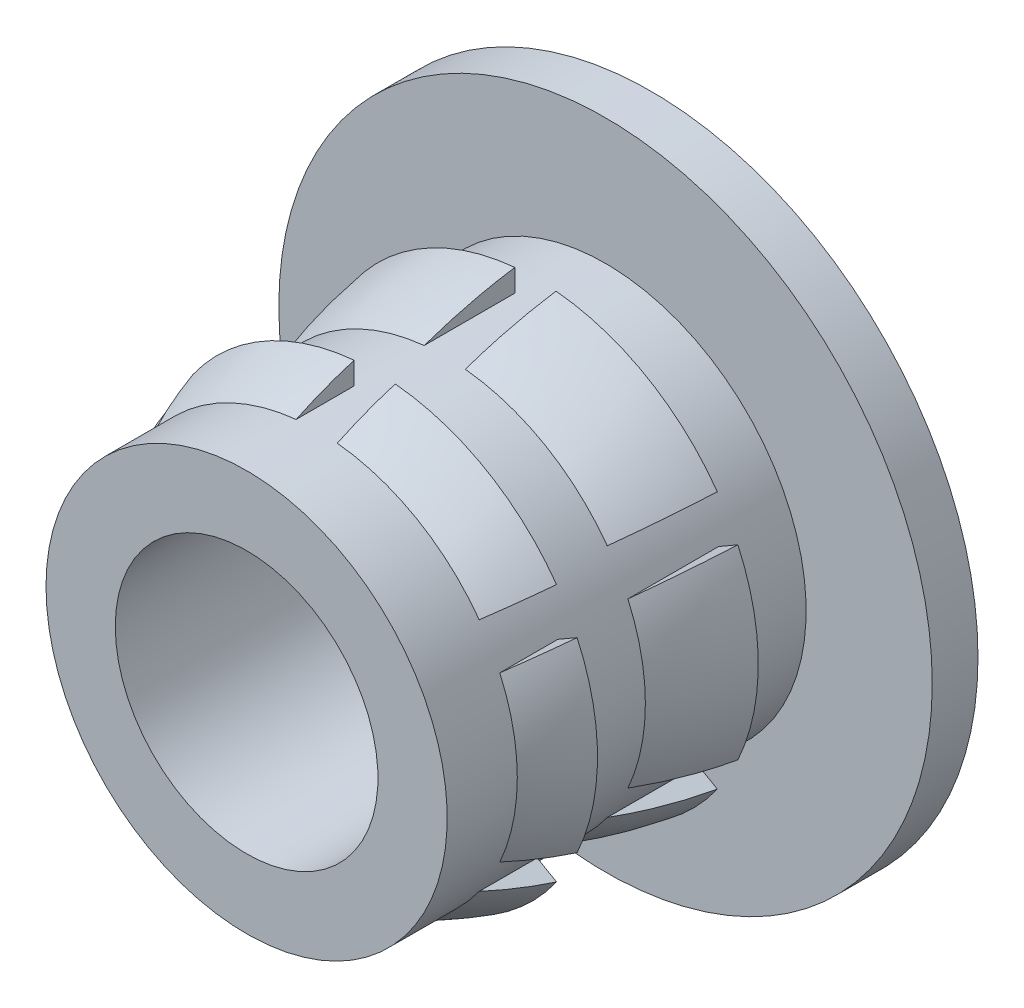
ISO-10303-21;
HEADER;
FILE_DESCRIPTION(('STEP AP214'),'2;1');
FILE_NAME('part.step','',(''),(''),'','','');
FILE_SCHEMA(('AUTOMOTIVE_DESIGN { 1 0 10303 214 1 1 1 1 }'));
ENDSEC;
DATA;
#1=APPLICATION_CONTEXT('core data for automotive mechanical design processes');
#2=APPLICATION_PROTOCOL_DEFINITION('international standard','automotive_design',2000,#1);
#3=PRODUCT_CONTEXT('',#1,'mechanical');
#4=PRODUCT('Part','Part','',(#3));
#5=PRODUCT_RELATED_PRODUCT_CATEGORY('part','',(#4));
#6=PRODUCT_DEFINITION_FORMATION('','',#4);
#7=PRODUCT_DEFINITION_CONTEXT('part definition',#1,'design');
#8=PRODUCT_DEFINITION('design','',#6,#7);
#9=PRODUCT_DEFINITION_SHAPE('','',#8);
#10=(LENGTH_UNIT() NAMED_UNIT(*) SI_UNIT(.MILLI.,.METRE.));
#11=(NAMED_UNIT(*) PLANE_ANGLE_UNIT() SI_UNIT($,.RADIAN.));
#12=(NAMED_UNIT(*) SI_UNIT($,.STERADIAN.) SOLID_ANGLE_UNIT());
#13=UNCERTAINTY_MEASURE_WITH_UNIT(LENGTH_MEASURE(1.E-05),#10,'distance_accuracy_value','');
#14=(GEOMETRIC_REPRESENTATION_CONTEXT(3) GLOBAL_UNCERTAINTY_ASSIGNED_CONTEXT((#13)) GLOBAL_UNIT_ASSIGNED_CONTEXT((#10,
#11,#12)) REPRESENTATION_CONTEXT('',''));
#15=CARTESIAN_POINT('',(0.,0.,0.));
#16=DIRECTION('',(0.,0.,1.));
#17=DIRECTION('',(1.,0.,0.));
#18=AXIS2_PLACEMENT_3D('',#15,#16,#17);
#19=CARTESIAN_POINT('',(7.13434757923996,0.,-19.2938107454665));
#20=DIRECTION('',(0.,0.,-1.));
#21=DIRECTION('',(-1.,0.,0.));
#22=AXIS2_PLACEMENT_3D('',#19,#20,#21);
#23=CONICAL_SURFACE('',#22,3.81000000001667,0.785398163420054);
#24=CARTESIAN_POINT('',(7.13434757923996,0.,-19.2938107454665));
#25=DIRECTION('',(0.,0.,-1.));
#26=DIRECTION('',(-1.,0.,0.));
#27=AXIS2_PLACEMENT_3D('',#24,#25,#26);
#28=CIRCLE('',#27,3.81000000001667);
#29=CARTESIAN_POINT('',(3.32434757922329,0.,-19.2938107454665));
#30=VERTEX_POINT('',#29);
#31=EDGE_CURVE('E20',#30,#30,#28,.T.);
#32=ORIENTED_EDGE('',*,*,#31,.T.);
#33=EDGE_LOOP('',(#32));
#34=FACE_BOUND('',#33,.T.);
#35=CARTESIAN_POINT('',(7.13434757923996,0.,-18.0365107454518));
#36=DIRECTION('',(0.,0.,-1.));
#37=DIRECTION('',(-1.,0.,0.));
#38=AXIS2_PLACEMENT_3D('',#35,#36,#37);
#39=CIRCLE('',#38,2.5527);
#40=CARTESIAN_POINT('',(4.58164757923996,0.,-18.0365107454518));
#41=VERTEX_POINT('',#40);
#42=EDGE_CURVE('E237',#41,#41,#39,.F.);
#43=ORIENTED_EDGE('',*,*,#42,.T.);
#44=EDGE_LOOP('',(#43));
#45=FACE_BOUND('',#44,.T.);
#46=ADVANCED_FACE('F17',(#34,#45),#23,.F.);
#47=CARTESIAN_POINT('',(7.13434757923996,0.,-19.2938107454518));
#48=DIRECTION('',(0.,0.,1.));
#49=DIRECTION('',(1.,0.,0.));
#50=AXIS2_PLACEMENT_3D('',#47,#48,#49);
#51=PLANE('',#50);
#52=CARTESIAN_POINT('',(7.13434757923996,0.,-19.2938107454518));
#53=DIRECTION('',(0.,0.,-1.));
#54=DIRECTION('',(-1.,0.,0.));
#55=AXIS2_PLACEMENT_3D('',#52,#53,#54);
#56=CIRCLE('',#55,6.35);
#57=CARTESIAN_POINT('',(0.78434757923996,0.,-19.2938107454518));
#58=VERTEX_POINT('',#57);
#59=EDGE_CURVE('E215',#58,#58,#56,.F.);
#60=ORIENTED_EDGE('',*,*,#59,.F.);
#61=EDGE_LOOP('',(#60));
#62=FACE_BOUND('',#61,.T.);
#63=ORIENTED_EDGE('',*,*,#31,.F.);
#64=EDGE_LOOP('',(#63));
#65=FACE_BOUND('',#64,.T.);
#66=ADVANCED_FACE('F1060',(#62,#65),#51,.F.);
#67=CARTESIAN_POINT('',(7.13434757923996,0.,-19.2938107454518));
#68=DIRECTION('',(0.,0.,-1.));
#69=DIRECTION('',(-1.,0.,0.));
#70=AXIS2_PLACEMENT_3D('',#67,#68,#69);
#71=CYLINDRICAL_SURFACE('',#70,2.5527);
#72=CARTESIAN_POINT('',(7.13434757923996,0.,-11.4292107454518));
#73=DIRECTION('',(0.,0.,-1.));
#74=DIRECTION('',(-1.,0.,0.));
#75=AXIS2_PLACEMENT_3D('',#72,#73,#74);
#76=CIRCLE('',#75,2.5527);
#77=CARTESIAN_POINT('',(4.58164757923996,0.,-11.4292107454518));
#78=VERTEX_POINT('',#77);
#79=EDGE_CURVE('E594',#78,#78,#76,.F.);
#80=ORIENTED_EDGE('',*,*,#79,.T.);
#81=EDGE_LOOP('',(#80));
#82=FACE_BOUND('',#81,.T.);
#83=ORIENTED_EDGE('',*,*,#42,.F.);
#84=EDGE_LOOP('',(#83));
#85=FACE_BOUND('',#84,.T.);
#86=ADVANCED_FACE('F1052',(#82,#85),#71,.F.);
#87=CARTESIAN_POINT('',(7.13434757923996,0.,-55.2887828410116));
#88=DIRECTION('',(0.,0.,-1.));
#89=DIRECTION('',(-1.,0.,0.));
#90=AXIS2_PLACEMENT_3D('',#87,#88,#89);
#91=CYLINDRICAL_SURFACE('',#90,6.35);
#92=CARTESIAN_POINT('',(7.13434757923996,0.,-18.4048107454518));
#93=DIRECTION('',(0.,0.,-1.));
#94=DIRECTION('',(-1.,0.,0.));
#95=AXIS2_PLACEMENT_3D('',#92,#93,#94);
#96=CIRCLE('',#95,6.35);
#97=CARTESIAN_POINT('',(0.78434757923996,0.,-18.4048107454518));
#98=VERTEX_POINT('',#97);
#99=EDGE_CURVE('E308',#98,#98,#96,.T.);
#100=ORIENTED_EDGE('',*,*,#99,.T.);
#101=EDGE_LOOP('',(#100));
#102=FACE_BOUND('',#101,.T.);
#103=ORIENTED_EDGE('',*,*,#59,.T.);
#104=EDGE_LOOP('',(#103));
#105=FACE_BOUND('',#104,.T.);
#106=ADVANCED_FACE('F1046',(#102,#105),#91,.T.);
#107=CARTESIAN_POINT('',(3.59988351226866,2.5025039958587,-17.4292107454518));
#108=DIRECTION('',(0.50000000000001,0.866025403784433,0.));
#109=DIRECTION('',(-0.866025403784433,0.50000000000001,0.));
#110=AXIS2_PLACEMENT_3D('',#107,#108,#109);
#111=PLANE('',#110);
#112=CARTESIAN_POINT('',(3.59988351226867,2.50250399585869,-17.0426107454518));
#113=CARTESIAN_POINT('',(3.63854852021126,2.48018074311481,-16.7428445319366));
#114=CARTESIAN_POINT('',(3.68934079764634,2.45085580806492,-16.4453902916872));
#115=CARTESIAN_POINT('',(3.76768744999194,2.40562234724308,-16.0779226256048));
#116=CARTESIAN_POINT('',(3.78408603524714,2.39615461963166,-16.0047026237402));
#117=CARTESIAN_POINT('',(3.81836962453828,2.37636098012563,-15.8586838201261));
#118=CARTESIAN_POINT('',(3.83625543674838,2.36603460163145,-15.7858852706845));
#119=CARTESIAN_POINT('',(3.87351635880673,2.34452199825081,-15.6407119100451));
#120=CARTESIAN_POINT('',(3.89289307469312,2.3333348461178,-15.5683376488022));
#121=CARTESIAN_POINT('',(3.93314144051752,2.31009744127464,-15.4240144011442));
#122=CARTESIAN_POINT('',(3.95401549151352,2.29804580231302,-15.3520663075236));
#123=CARTESIAN_POINT('',(3.9756177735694,2.28557371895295,-15.2804107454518));
#124=B_SPLINE_CURVE_WITH_KNOTS('',3,(#112,#113,#114,#115,#116,#117,#118,#119,#120,#121,#122,
#123),.UNSPECIFIED.,.F.,.F.,(4,2,2,2,2,4),(0.,0.908405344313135,1.13527409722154,
1.3622669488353,1.58950784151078,1.81712164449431),.UNSPECIFIED.);
#125=CARTESIAN_POINT('',(3.59988351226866,2.50250399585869,-17.0426107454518));
#126=VERTEX_POINT('',#125);
#127=CARTESIAN_POINT('',(3.97561777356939,2.28557371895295,-15.2804107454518));
#128=VERTEX_POINT('',#127);
#129=EDGE_CURVE('E218',#126,#128,#124,.T.);
#130=ORIENTED_EDGE('',*,*,#129,.F.);
#131=DIRECTION('',(0.866025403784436,-0.500000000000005,0.));
#132=VECTOR('',#131,1.);
#133=CARTESIAN_POINT('',(3.59988351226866,2.50250399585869,-17.0426107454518));
#134=LINE('',#133,#132);
#135=CARTESIAN_POINT('',(3.97561777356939,2.28557371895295,-17.0426107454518));
#136=VERTEX_POINT('',#135);
#137=EDGE_CURVE('E207',#126,#136,#134,.T.);
#138=ORIENTED_EDGE('',*,*,#137,.T.);
#139=DIRECTION('',(0.,0.,-1.));
#140=VECTOR('',#139,1.);
#141=CARTESIAN_POINT('',(3.97561777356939,2.28557371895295,-55.2887828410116));
#142=LINE('',#141,#140);
#143=EDGE_CURVE('E220',#128,#136,#142,.T.);
#144=ORIENTED_EDGE('',*,*,#143,.F.);
#145=EDGE_LOOP('',(#130,#138,#144));
#146=FACE_BOUND('',#145,.T.);
#147=ADVANCED_FACE('F219',(#146),#111,.F.);
#148=CARTESIAN_POINT('',(11.03324757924,0.,-17.0426107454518));
#149=DIRECTION('',(0.,0.,1.));
#150=DIRECTION('',(1.,0.,0.));
#151=AXIS2_PLACEMENT_3D('',#148,#149,#150);
#152=PLANE('',#151);
#153=ORIENTED_EDGE('',*,*,#137,.F.);
#154=CARTESIAN_POINT('',(7.13434757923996,0.,-17.0426107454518));
#155=DIRECTION('',(0.,0.,-1.));
#156=DIRECTION('',(-1.,0.,0.));
#157=AXIS2_PLACEMENT_3D('',#154,#155,#156);
#158=CIRCLE('',#157,4.3307);
#159=CARTESIAN_POINT('',(6.73434757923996,4.31218766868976,-17.0426107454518));
#160=VERTEX_POINT('',#159);
#161=EDGE_CURVE('E203',#160,#126,#158,.F.);
#162=ORIENTED_EDGE('',*,*,#161,.F.);
#163=DIRECTION('',(0.,1.,0.));
#164=VECTOR('',#163,1.);
#165=CARTESIAN_POINT('',(6.73434757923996,4.31218766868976,-17.0426107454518));
#166=LINE('',#165,#164);
#167=CARTESIAN_POINT('',(6.73434757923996,3.87832711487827,-17.0426107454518));
#168=VERTEX_POINT('',#167);
#169=EDGE_CURVE('E214',#160,#168,#166,.F.);
#170=ORIENTED_EDGE('',*,*,#169,.T.);
#171=CARTESIAN_POINT('',(7.13434757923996,0.,-17.0426107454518));
#172=DIRECTION('',(0.,0.,-1.));
#173=DIRECTION('',(-1.,0.,0.));
#174=AXIS2_PLACEMENT_3D('',#171,#172,#173);
#175=CIRCLE('',#174,3.8989);
#176=EDGE_CURVE('E211',#136,#168,#175,.T.);
#177=ORIENTED_EDGE('',*,*,#176,.F.);
#178=EDGE_LOOP('',(#153,#162,#170,#177));
#179=FACE_BOUND('',#178,.T.);
#180=ADVANCED_FACE('F209',(#179),#152,.F.);
#181=CARTESIAN_POINT('',(6.73434757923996,4.31218766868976,-17.4292107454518));
#182=DIRECTION('',(-1.,0.,0.));
#183=DIRECTION('',(0.,0.,1.));
#184=AXIS2_PLACEMENT_3D('',#181,#182,#183);
#185=PLANE('',#184);
#186=DIRECTION('',(0.,0.,-1.));
#187=VECTOR('',#186,1.);
#188=CARTESIAN_POINT('',(6.73434757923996,3.87832711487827,-55.2887828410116));
#189=LINE('',#188,#187);
#190=CARTESIAN_POINT('',(6.73434757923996,3.87832711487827,-15.2804107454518));
#191=VERTEX_POINT('',#190);
#192=EDGE_CURVE('E307',#168,#191,#189,.F.);
#193=ORIENTED_EDGE('',*,*,#192,.F.);
#194=ORIENTED_EDGE('',*,*,#169,.F.);
#195=CARTESIAN_POINT('',(6.73434757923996,3.87832711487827,-15.2804107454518));
#196=CARTESIAN_POINT('',(6.73434757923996,3.9032712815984,-15.3520663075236));
#197=CARTESIAN_POINT('',(6.73434757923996,3.92737455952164,-15.4240144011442));
#198=CARTESIAN_POINT('',(6.73434757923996,3.97384936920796,-15.5683376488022));
#199=CARTESIAN_POINT('',(6.73434757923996,3.99622367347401,-15.6407119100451));
#200=CARTESIAN_POINT('',(6.73434757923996,4.03924888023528,-15.7858852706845));
#201=CARTESIAN_POINT('',(6.73434757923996,4.05990163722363,-15.8586838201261));
#202=CARTESIAN_POINT('',(6.73434757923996,4.09948891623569,-16.0047026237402));
#203=CARTESIAN_POINT('',(6.73434757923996,4.11842437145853,-16.0779226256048));
#204=CARTESIAN_POINT('',(6.73434757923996,4.20889129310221,-16.4453902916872));
#205=CARTESIAN_POINT('',(6.73434757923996,4.26754116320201,-16.7428445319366));
#206=CARTESIAN_POINT('',(6.73434757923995,4.31218766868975,-17.0426107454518));
#207=B_SPLINE_CURVE_WITH_KNOTS('',3,(#195,#196,#197,#198,#199,#200,#201,#202,#203,#204,#205,
#206),.UNSPECIFIED.,.F.,.F.,(4,2,2,2,2,4),(0.,0.227613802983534,0.454854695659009,
0.681847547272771,0.90871630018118,1.81712164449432),.UNSPECIFIED.);
#208=EDGE_CURVE('E224',#191,#160,#207,.T.);
#209=ORIENTED_EDGE('',*,*,#208,.F.);
#210=EDGE_LOOP('',(#193,#194,#209));
#211=FACE_BOUND('',#210,.T.);
#212=ADVANCED_FACE('F716',(#211),#185,.F.);
#213=CARTESIAN_POINT('',(12.4612298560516,0.,-18.4750497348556));
#214=DIRECTION('',(0.,1.,0.));
#215=DIRECTION('',(-1.,0.,0.));
#216=AXIS2_PLACEMENT_3D('',#213,#214,#215);
#217=CIRCLE('',#216,9.76323598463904);
#218=TRIMMED_CURVE('',#217,(PARAMETER_VALUE(-0.993684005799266)),
(PARAMETER_VALUE(0.993684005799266)),.T.,.PARAMETER.);
#219=CARTESIAN_POINT('',(7.13434757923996,0.,-18.4750497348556));
#220=DIRECTION('',(0.,0.,-1.));
#221=AXIS1_PLACEMENT('',#219,#220);
#222=SURFACE_OF_REVOLUTION('',#218,#221);
#223=CARTESIAN_POINT('',(7.13434757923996,0.,-15.2804107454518));
#224=DIRECTION('',(0.,0.,-1.));
#225=DIRECTION('',(-1.,0.,0.));
#226=AXIS2_PLACEMENT_3D('',#223,#224,#225);
#227=CIRCLE('',#226,3.8989);
#228=EDGE_CURVE('E701',#191,#128,#227,.F.);
#229=ORIENTED_EDGE('',*,*,#228,.F.);
#230=ORIENTED_EDGE('',*,*,#208,.T.);
#231=ORIENTED_EDGE('',*,*,#161,.T.);
#232=ORIENTED_EDGE('',*,*,#129,.T.);
#233=EDGE_LOOP('',(#229,#230,#231,#232));
#234=FACE_BOUND('',#233,.T.);
#235=ADVANCED_FACE('F227',(#234),#222,.F.);
#236=CARTESIAN_POINT('',(3.59988351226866,2.5025039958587,-17.4292107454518));
#237=DIRECTION('',(0.50000000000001,0.866025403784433,0.));
#238=DIRECTION('',(-0.866025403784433,0.50000000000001,0.));
#239=AXIS2_PLACEMENT_3D('',#236,#237,#238);
#240=PLANE('',#239);
#241=CARTESIAN_POINT('',(3.59988351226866,2.5025039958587,-13.9182107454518));
#242=CARTESIAN_POINT('',(3.64988760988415,2.47363411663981,-13.7248006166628));
#243=CARTESIAN_POINT('',(3.70620084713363,2.44112165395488,-13.5341955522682));
#244=CARTESIAN_POINT('',(3.83144560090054,2.36881156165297,-13.1585955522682));
#245=CARTESIAN_POINT('',(3.90037711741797,2.32901393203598,-12.9736006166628));
#246=CARTESIAN_POINT('',(3.97561777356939,2.28557371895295,-12.7914107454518));
#247=B_SPLINE_CURVE_WITH_KNOTS('',3,(#241,#242,#243,#244,#245,#246),.UNSPECIFIED.,.F.,.F.,(4,2,
4),(0.,0.6041744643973,1.2083489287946),.UNSPECIFIED.);
#248=CARTESIAN_POINT('',(3.59988351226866,2.50250399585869,-13.9182107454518));
#249=VERTEX_POINT('',#248);
#250=CARTESIAN_POINT('',(3.97561777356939,2.28557371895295,-12.7914107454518));
#251=VERTEX_POINT('',#250);
#252=EDGE_CURVE('E677',#249,#251,#247,.T.);
#253=ORIENTED_EDGE('',*,*,#252,.F.);
#254=DIRECTION('',(0.866025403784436,-0.500000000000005,0.));
#255=VECTOR('',#254,1.);
#256=CARTESIAN_POINT('',(3.59988351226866,2.50250399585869,-13.9182107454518));
#257=LINE('',#256,#255);
#258=CARTESIAN_POINT('',(3.97561777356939,2.28557371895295,-13.9182107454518));
#259=VERTEX_POINT('',#258);
#260=EDGE_CURVE('E706',#249,#259,#257,.T.);
#261=ORIENTED_EDGE('',*,*,#260,.T.);
#262=DIRECTION('',(0.,0.,-1.));
#263=VECTOR('',#262,1.);
#264=CARTESIAN_POINT('',(3.97561777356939,2.28557371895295,-55.2887828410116));
#265=LINE('',#264,#263);
#266=EDGE_CURVE('E305',#251,#259,#265,.T.);
#267=ORIENTED_EDGE('',*,*,#266,.F.);
#268=EDGE_LOOP('',(#253,#261,#267));
#269=FACE_BOUND('',#268,.T.);
#270=ADVANCED_FACE('F715',(#269),#240,.F.);
#271=CARTESIAN_POINT('',(11.03324757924,0.,-13.9182107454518));
#272=DIRECTION('',(0.,0.,1.));
#273=DIRECTION('',(1.,0.,0.));
#274=AXIS2_PLACEMENT_3D('',#271,#272,#273);
#275=PLANE('',#274);
#276=ORIENTED_EDGE('',*,*,#260,.F.);
#277=CARTESIAN_POINT('',(7.13434757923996,0.,-13.9182107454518));
#278=DIRECTION('',(0.,0.,-1.));
#279=DIRECTION('',(-1.,0.,0.));
#280=AXIS2_PLACEMENT_3D('',#277,#278,#279);
#281=CIRCLE('',#280,4.3307);
#282=CARTESIAN_POINT('',(6.73434757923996,4.31218766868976,-13.9182107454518));
#283=VERTEX_POINT('',#282);
#284=EDGE_CURVE('E705',#283,#249,#281,.F.);
#285=ORIENTED_EDGE('',*,*,#284,.F.);
#286=DIRECTION('',(0.,1.,0.));
#287=VECTOR('',#286,1.);
#288=CARTESIAN_POINT('',(6.73434757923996,4.31218766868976,-13.9182107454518));
#289=LINE('',#288,#287);
#290=CARTESIAN_POINT('',(6.73434757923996,3.87832711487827,-13.9182107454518));
#291=VERTEX_POINT('',#290);
#292=EDGE_CURVE('E702',#283,#291,#289,.F.);
#293=ORIENTED_EDGE('',*,*,#292,.T.);
#294=CARTESIAN_POINT('',(7.13434757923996,0.,-13.9182107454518));
#295=DIRECTION('',(0.,0.,-1.));
#296=DIRECTION('',(-1.,0.,0.));
#297=AXIS2_PLACEMENT_3D('',#294,#295,#296);
#298=CIRCLE('',#297,3.8989);
#299=EDGE_CURVE('E301',#259,#291,#298,.T.);
#300=ORIENTED_EDGE('',*,*,#299,.F.);
#301=EDGE_LOOP('',(#276,#285,#293,#300));
#302=FACE_BOUND('',#301,.T.);
#303=ADVANCED_FACE('F1016',(#302),#275,.F.);
#304=CARTESIAN_POINT('',(6.73434757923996,4.31218766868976,-17.4292107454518));
#305=DIRECTION('',(-1.,0.,0.));
#306=DIRECTION('',(0.,0.,1.));
#307=AXIS2_PLACEMENT_3D('',#304,#305,#306);
#308=PLANE('',#307);
#309=DIRECTION('',(0.,0.,-1.));
#310=VECTOR('',#309,1.);
#311=CARTESIAN_POINT('',(6.73434757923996,3.87832711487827,-55.2887828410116));
#312=LINE('',#311,#310);
#313=CARTESIAN_POINT('',(6.73434757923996,3.87832711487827,-12.7914107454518));
#314=VERTEX_POINT('',#313);
#315=EDGE_CURVE('E304',#291,#314,#312,.F.);
#316=ORIENTED_EDGE('',*,*,#315,.F.);
#317=ORIENTED_EDGE('',*,*,#292,.F.);
#318=CARTESIAN_POINT('',(6.73434757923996,3.87832711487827,-12.7914107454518));
#319=CARTESIAN_POINT('',(6.73434757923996,3.96520754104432,-12.9736006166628));
#320=CARTESIAN_POINT('',(6.73434757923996,4.04480280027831,-13.1585955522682));
#321=CARTESIAN_POINT('',(6.73434757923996,4.18942298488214,-13.5341955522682));
#322=CARTESIAN_POINT('',(6.73434757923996,4.25444791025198,-13.7248006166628));
#323=CARTESIAN_POINT('',(6.73434757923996,4.31218766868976,-13.9182107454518));
#324=B_SPLINE_CURVE_WITH_KNOTS('',3,(#318,#319,#320,#321,#322,#323),.UNSPECIFIED.,.F.,.F.,(4,2,
4),(0.,0.604174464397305,1.20834892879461),.UNSPECIFIED.);
#325=EDGE_CURVE('E669',#314,#283,#324,.T.);
#326=ORIENTED_EDGE('',*,*,#325,.F.);
#327=EDGE_LOOP('',(#316,#317,#326));
#328=FACE_BOUND('',#327,.T.);
#329=ADVANCED_FACE('F683',(#328),#308,.F.);
#330=CARTESIAN_POINT('',(10.3117859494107,0.,-16.1492627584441));
#331=DIRECTION('',(0.,1.,0.));
#332=DIRECTION('',(-1.,0.,0.));
#333=AXIS2_PLACEMENT_3D('',#330,#331,#332);
#334=CIRCLE('',#333,7.83260715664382);
#335=TRIMMED_CURVE('',#334,(PARAMETER_VALUE(-1.1530867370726)),
(PARAMETER_VALUE(1.1530867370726)),.T.,.PARAMETER.);
#336=CARTESIAN_POINT('',(7.13434757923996,0.,-16.1492627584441));
#337=DIRECTION('',(0.,0.,-1.));
#338=AXIS1_PLACEMENT('',#336,#337);
#339=SURFACE_OF_REVOLUTION('',#335,#338);
#340=CARTESIAN_POINT('',(7.13434757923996,0.,-12.7914107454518));
#341=DIRECTION('',(0.,0.,-1.));
#342=DIRECTION('',(-1.,0.,0.));
#343=AXIS2_PLACEMENT_3D('',#340,#341,#342);
#344=CIRCLE('',#343,3.8989);
#345=EDGE_CURVE('E300',#314,#251,#344,.F.);
#346=ORIENTED_EDGE('',*,*,#345,.F.);
#347=ORIENTED_EDGE('',*,*,#325,.T.);
#348=ORIENTED_EDGE('',*,*,#284,.T.);
#349=ORIENTED_EDGE('',*,*,#252,.T.);
#350=EDGE_LOOP('',(#346,#347,#348,#349));
#351=FACE_BOUND('',#350,.T.);
#352=ADVANCED_FACE('F686',(#351),#339,.F.);
#353=CARTESIAN_POINT('',(11.03324757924,0.,-13.9182107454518));
#354=DIRECTION('',(0.,0.,1.));
#355=DIRECTION('',(1.,0.,0.));
#356=AXIS2_PLACEMENT_3D('',#353,#354,#355);
#357=PLANE('',#356);
#358=DIRECTION('',(0.866025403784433,-0.50000000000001,0.));
#359=VECTOR('',#358,1.);
#360=CARTESIAN_POINT('',(3.19988351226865,1.80968367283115,-13.9182107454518));
#361=LINE('',#360,#359);
#362=CARTESIAN_POINT('',(3.19988351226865,1.80968367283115,-13.9182107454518));
#363=VERTEX_POINT('',#362);
#364=CARTESIAN_POINT('',(3.57561777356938,1.5927533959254,-13.9182107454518));
#365=VERTEX_POINT('',#364);
#366=EDGE_CURVE('E668',#363,#365,#361,.T.);
#367=ORIENTED_EDGE('',*,*,#366,.T.);
#368=CARTESIAN_POINT('',(7.13434757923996,0.,-13.9182107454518));
#369=DIRECTION('',(0.,0.,-1.));
#370=DIRECTION('',(-1.,0.,0.));
#371=AXIS2_PLACEMENT_3D('',#368,#369,#370);
#372=CIRCLE('',#371,3.8989);
#373=CARTESIAN_POINT('',(3.57561777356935,-1.59275339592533,-13.9182107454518));
#374=VERTEX_POINT('',#373);
#375=EDGE_CURVE('E296',#374,#365,#372,.T.);
#376=ORIENTED_EDGE('',*,*,#375,.F.);
#377=DIRECTION('',(-0.866025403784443,-0.499999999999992,0.));
#378=VECTOR('',#377,1.);
#379=CARTESIAN_POINT('',(3.19988351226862,-1.80968367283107,-13.9182107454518));
#380=LINE('',#379,#378);
#381=CARTESIAN_POINT('',(3.19988351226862,-1.80968367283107,-13.9182107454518));
#382=VERTEX_POINT('',#381);
#383=EDGE_CURVE('E632',#374,#382,#380,.T.);
#384=ORIENTED_EDGE('',*,*,#383,.T.);
#385=CARTESIAN_POINT('',(7.13434757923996,0.,-13.9182107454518));
#386=DIRECTION('',(0.,0.,-1.));
#387=DIRECTION('',(-1.,0.,0.));
#388=AXIS2_PLACEMENT_3D('',#385,#386,#387);
#389=CIRCLE('',#388,4.3307);
#390=EDGE_CURVE('E634',#363,#382,#389,.F.);
#391=ORIENTED_EDGE('',*,*,#390,.F.);
#392=EDGE_LOOP('',(#367,#376,#384,#391));
#393=FACE_BOUND('',#392,.T.);
#394=ADVANCED_FACE('F690',(#393),#357,.F.);
#395=CARTESIAN_POINT('',(3.19988351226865,1.80968367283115,-17.4292107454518));
#396=DIRECTION('',(-0.50000000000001,-0.866025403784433,0.));
#397=DIRECTION('',(0.866025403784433,-0.50000000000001,0.));
#398=AXIS2_PLACEMENT_3D('',#395,#396,#397);
#399=PLANE('',#398);
#400=DIRECTION('',(0.,0.,-1.));
#401=VECTOR('',#400,1.);
#402=CARTESIAN_POINT('',(3.57561777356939,1.5927533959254,-55.2887828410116));
#403=LINE('',#402,#401);
#404=CARTESIAN_POINT('',(3.57561777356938,1.5927533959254,-12.7914107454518));
#405=VERTEX_POINT('',#404);
#406=EDGE_CURVE('E299',#365,#405,#403,.F.);
#407=ORIENTED_EDGE('',*,*,#406,.F.);
#408=ORIENTED_EDGE('',*,*,#366,.F.);
#409=CARTESIAN_POINT('',(3.57561777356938,1.5927533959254,-12.7914107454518));
#410=CARTESIAN_POINT('',(3.50037711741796,1.63619360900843,-12.9736006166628));
#411=CARTESIAN_POINT('',(3.43144560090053,1.67599123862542,-13.1585955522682));
#412=CARTESIAN_POINT('',(3.30620084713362,1.74830133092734,-13.5341955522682));
#413=CARTESIAN_POINT('',(3.24988760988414,1.78081379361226,-13.7248006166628));
#414=CARTESIAN_POINT('',(3.19988351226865,1.80968367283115,-13.9182107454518));
#415=B_SPLINE_CURVE_WITH_KNOTS('',3,(#409,#410,#411,#412,#413,#414),.UNSPECIFIED.,.F.,.F.,(4,2,
4),(0.,0.604174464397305,1.20834892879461),.UNSPECIFIED.);
#416=EDGE_CURVE('E662',#405,#363,#415,.T.);
#417=ORIENTED_EDGE('',*,*,#416,.F.);
#418=EDGE_LOOP('',(#407,#408,#417));
#419=FACE_BOUND('',#418,.T.);
#420=ADVANCED_FACE('F650',(#419),#399,.F.);
#421=CARTESIAN_POINT('',(10.3117859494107,0.,-16.1492627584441));
#422=DIRECTION('',(0.,1.,0.));
#423=DIRECTION('',(-1.,0.,0.));
#424=AXIS2_PLACEMENT_3D('',#421,#422,#423);
#425=CIRCLE('',#424,7.83260715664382);
#426=TRIMMED_CURVE('',#425,(PARAMETER_VALUE(-1.1530867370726)),
(PARAMETER_VALUE(1.1530867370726)),.T.,.PARAMETER.);
#427=CARTESIAN_POINT('',(7.13434757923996,0.,-16.1492627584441));
#428=DIRECTION('',(0.,0.,-1.));
#429=AXIS1_PLACEMENT('',#427,#428);
#430=SURFACE_OF_REVOLUTION('',#426,#429);
#431=ORIENTED_EDGE('',*,*,#390,.T.);
#432=CARTESIAN_POINT('',(3.19988351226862,-1.80968367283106,-13.9182107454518));
#433=CARTESIAN_POINT('',(3.24988760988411,-1.78081379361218,-13.7248006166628));
#434=CARTESIAN_POINT('',(3.30620084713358,-1.74830133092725,-13.5341955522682));
#435=CARTESIAN_POINT('',(3.43144560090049,-1.67599123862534,-13.1585955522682));
#436=CARTESIAN_POINT('',(3.50037711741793,-1.63619360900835,-12.9736006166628));
#437=CARTESIAN_POINT('',(3.57561777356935,-1.59275339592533,-12.7914107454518));
#438=B_SPLINE_CURVE_WITH_KNOTS('',3,(#432,#433,#434,#435,#436,#437),.UNSPECIFIED.,.F.,.F.,(4,2,
4),(0.,0.604174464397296,1.20834892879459),.UNSPECIFIED.);
#439=CARTESIAN_POINT('',(3.57561777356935,-1.59275339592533,-12.7914107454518));
#440=VERTEX_POINT('',#439);
#441=EDGE_CURVE('E631',#382,#440,#438,.T.);
#442=ORIENTED_EDGE('',*,*,#441,.T.);
#443=CARTESIAN_POINT('',(7.13434757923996,0.,-12.7914107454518));
#444=DIRECTION('',(0.,0.,-1.));
#445=DIRECTION('',(-1.,0.,0.));
#446=AXIS2_PLACEMENT_3D('',#443,#444,#445);
#447=CIRCLE('',#446,3.8989);
#448=EDGE_CURVE('E635',#405,#440,#447,.F.);
#449=ORIENTED_EDGE('',*,*,#448,.F.);
#450=ORIENTED_EDGE('',*,*,#416,.T.);
#451=EDGE_LOOP('',(#431,#442,#449,#450));
#452=FACE_BOUND('',#451,.T.);
#453=ADVANCED_FACE('F644',(#452),#430,.F.);
#454=CARTESIAN_POINT('',(3.19988351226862,-1.80968367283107,-17.4292107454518));
#455=DIRECTION('',(-0.499999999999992,0.866025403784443,0.));
#456=DIRECTION('',(-0.866025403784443,-0.499999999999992,0.));
#457=AXIS2_PLACEMENT_3D('',#454,#455,#456);
#458=PLANE('',#457);
#459=ORIENTED_EDGE('',*,*,#441,.F.);
#460=ORIENTED_EDGE('',*,*,#383,.F.);
#461=DIRECTION('',(0.,0.,-1.));
#462=VECTOR('',#461,1.);
#463=CARTESIAN_POINT('',(3.57561777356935,-1.59275339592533,-55.2887828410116));
#464=LINE('',#463,#462);
#465=EDGE_CURVE('E295',#440,#374,#464,.T.);
#466=ORIENTED_EDGE('',*,*,#465,.F.);
#467=EDGE_LOOP('',(#459,#460,#466));
#468=FACE_BOUND('',#467,.T.);
#469=ADVANCED_FACE('F649',(#468),#458,.F.);
#470=CARTESIAN_POINT('',(11.03324757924,0.,-17.0426107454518));
#471=DIRECTION('',(0.,0.,1.));
#472=DIRECTION('',(1.,0.,0.));
#473=AXIS2_PLACEMENT_3D('',#470,#471,#472);
#474=PLANE('',#473);
#475=DIRECTION('',(0.866025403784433,-0.50000000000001,0.));
#476=VECTOR('',#475,1.);
#477=CARTESIAN_POINT('',(3.19988351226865,1.80968367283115,-17.0426107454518));
#478=LINE('',#477,#476);
#479=CARTESIAN_POINT('',(3.19988351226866,1.80968367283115,-17.0426107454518));
#480=VERTEX_POINT('',#479);
#481=CARTESIAN_POINT('',(3.57561777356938,1.5927533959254,-17.0426107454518));
#482=VERTEX_POINT('',#481);
#483=EDGE_CURVE('E627',#480,#482,#478,.T.);
#484=ORIENTED_EDGE('',*,*,#483,.T.);
#485=CARTESIAN_POINT('',(7.13434757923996,0.,-17.0426107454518));
#486=DIRECTION('',(0.,0.,-1.));
#487=DIRECTION('',(-1.,0.,0.));
#488=AXIS2_PLACEMENT_3D('',#485,#486,#487);
#489=CIRCLE('',#488,3.8989);
#490=CARTESIAN_POINT('',(3.57561777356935,-1.59275339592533,-17.0426107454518));
#491=VERTEX_POINT('',#490);
#492=EDGE_CURVE('E291',#491,#482,#489,.T.);
#493=ORIENTED_EDGE('',*,*,#492,.F.);
#494=DIRECTION('',(-0.866025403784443,-0.499999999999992,0.));
#495=VECTOR('',#494,1.);
#496=CARTESIAN_POINT('',(3.19988351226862,-1.80968367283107,-17.0426107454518));
#497=LINE('',#496,#495);
#498=CARTESIAN_POINT('',(3.19988351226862,-1.80968367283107,-17.0426107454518));
#499=VERTEX_POINT('',#498);
#500=EDGE_CURVE('E604',#491,#499,#497,.T.);
#501=ORIENTED_EDGE('',*,*,#500,.T.);
#502=CARTESIAN_POINT('',(7.13434757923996,0.,-17.0426107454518));
#503=DIRECTION('',(0.,0.,-1.));
#504=DIRECTION('',(-1.,0.,0.));
#505=AXIS2_PLACEMENT_3D('',#502,#503,#504);
#506=CIRCLE('',#505,4.3307);
#507=EDGE_CURVE('E605',#480,#499,#506,.F.);
#508=ORIENTED_EDGE('',*,*,#507,.F.);
#509=EDGE_LOOP('',(#484,#493,#501,#508));
#510=FACE_BOUND('',#509,.T.);
#511=ADVANCED_FACE('F973',(#510),#474,.F.);
#512=CARTESIAN_POINT('',(3.19988351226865,1.80968367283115,-17.4292107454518));
#513=DIRECTION('',(-0.50000000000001,-0.866025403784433,0.));
#514=DIRECTION('',(0.866025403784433,-0.50000000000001,0.));
#515=AXIS2_PLACEMENT_3D('',#512,#513,#514);
#516=PLANE('',#515);
#517=DIRECTION('',(0.,0.,-1.));
#518=VECTOR('',#517,1.);
#519=CARTESIAN_POINT('',(3.57561777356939,1.5927533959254,-55.2887828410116));
#520=LINE('',#519,#518);
#521=CARTESIAN_POINT('',(3.57561777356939,1.5927533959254,-15.2804107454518));
#522=VERTEX_POINT('',#521);
#523=EDGE_CURVE('E294',#482,#522,#520,.F.);
#524=ORIENTED_EDGE('',*,*,#523,.F.);
#525=ORIENTED_EDGE('',*,*,#483,.F.);
#526=CARTESIAN_POINT('',(3.57561777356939,1.5927533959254,-15.2804107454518));
#527=CARTESIAN_POINT('',(3.55401549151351,1.60522547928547,-15.3520663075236));
#528=CARTESIAN_POINT('',(3.53314144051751,1.61727711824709,-15.4240144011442));
#529=CARTESIAN_POINT('',(3.49289307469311,1.64051452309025,-15.5683376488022));
#530=CARTESIAN_POINT('',(3.47351635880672,1.65170167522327,-15.6407119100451));
#531=CARTESIAN_POINT('',(3.43625543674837,1.67321427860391,-15.7858852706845));
#532=CARTESIAN_POINT('',(3.41836962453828,1.68354065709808,-15.8586838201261));
#533=CARTESIAN_POINT('',(3.38408603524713,1.70333429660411,-16.0047026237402));
#534=CARTESIAN_POINT('',(3.36768744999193,1.71280202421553,-16.0779226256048));
#535=CARTESIAN_POINT('',(3.28934079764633,1.75803548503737,-16.4453902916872));
#536=CARTESIAN_POINT('',(3.23854852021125,1.78736042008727,-16.7428445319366));
#537=CARTESIAN_POINT('',(3.19988351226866,1.80968367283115,-17.0426107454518));
#538=B_SPLINE_CURVE_WITH_KNOTS('',3,(#526,#527,#528,#529,#530,#531,#532,#533,#534,#535,#536,
#537),.UNSPECIFIED.,.F.,.F.,(4,2,2,2,2,4),(0.,0.227613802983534,0.454854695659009,
0.681847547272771,0.90871630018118,1.81712164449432),.UNSPECIFIED.);
#539=EDGE_CURVE('E630',#522,#480,#538,.T.);
#540=ORIENTED_EDGE('',*,*,#539,.F.);
#541=EDGE_LOOP('',(#524,#525,#540));
#542=FACE_BOUND('',#541,.T.);
#543=ADVANCED_FACE('F615',(#542),#516,.F.);
#544=CARTESIAN_POINT('',(12.4612298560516,0.,-18.4750497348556));
#545=DIRECTION('',(0.,1.,0.));
#546=DIRECTION('',(-1.,0.,0.));
#547=AXIS2_PLACEMENT_3D('',#544,#545,#546);
#548=CIRCLE('',#547,9.76323598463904);
#549=TRIMMED_CURVE('',#548,(PARAMETER_VALUE(-0.993684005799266)),
(PARAMETER_VALUE(0.993684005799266)),.T.,.PARAMETER.);
#550=CARTESIAN_POINT('',(7.13434757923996,0.,-18.4750497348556));
#551=DIRECTION('',(0.,0.,-1.));
#552=AXIS1_PLACEMENT('',#550,#551);
#553=SURFACE_OF_REVOLUTION('',#549,#552);
#554=ORIENTED_EDGE('',*,*,#507,.T.);
#555=CARTESIAN_POINT('',(3.19988351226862,-1.80968367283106,-17.0426107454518));
#556=CARTESIAN_POINT('',(3.23854852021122,-1.78736042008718,-16.7428445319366));
#557=CARTESIAN_POINT('',(3.2893407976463,-1.75803548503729,-16.4453902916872));
#558=CARTESIAN_POINT('',(3.36768744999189,-1.71280202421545,-16.0779226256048));
#559=CARTESIAN_POINT('',(3.3840860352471,-1.70333429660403,-16.0047026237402));
#560=CARTESIAN_POINT('',(3.41836962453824,-1.68354065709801,-15.8586838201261));
#561=CARTESIAN_POINT('',(3.43625543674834,-1.67321427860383,-15.7858852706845));
#562=CARTESIAN_POINT('',(3.47351635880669,-1.65170167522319,-15.6407119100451));
#563=CARTESIAN_POINT('',(3.49289307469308,-1.64051452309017,-15.5683376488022));
#564=CARTESIAN_POINT('',(3.53314144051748,-1.61727711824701,-15.4240144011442));
#565=CARTESIAN_POINT('',(3.55401549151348,-1.60522547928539,-15.3520663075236));
#566=CARTESIAN_POINT('',(3.57561777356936,-1.59275339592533,-15.2804107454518));
#567=B_SPLINE_CURVE_WITH_KNOTS('',3,(#555,#556,#557,#558,#559,#560,#561,#562,#563,#564,#565,
#566),.UNSPECIFIED.,.F.,.F.,(4,2,2,2,2,4),(0.,0.908405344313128,1.13527409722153,
1.3622669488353,1.58950784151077,1.8171216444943),.UNSPECIFIED.);
#568=CARTESIAN_POINT('',(3.57561777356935,-1.59275339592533,-15.2804107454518));
#569=VERTEX_POINT('',#568);
#570=EDGE_CURVE('E597',#499,#569,#567,.T.);
#571=ORIENTED_EDGE('',*,*,#570,.T.);
#572=CARTESIAN_POINT('',(7.13434757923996,0.,-15.2804107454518));
#573=DIRECTION('',(0.,0.,-1.));
#574=DIRECTION('',(-1.,0.,0.));
#575=AXIS2_PLACEMENT_3D('',#572,#573,#574);
#576=CIRCLE('',#575,3.8989);
#577=EDGE_CURVE('E626',#522,#569,#576,.F.);
#578=ORIENTED_EDGE('',*,*,#577,.F.);
#579=ORIENTED_EDGE('',*,*,#539,.T.);
#580=EDGE_LOOP('',(#554,#571,#578,#579));
#581=FACE_BOUND('',#580,.T.);
#582=ADVANCED_FACE('F610',(#581),#553,.F.);
#583=CARTESIAN_POINT('',(3.19988351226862,-1.80968367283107,-17.4292107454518));
#584=DIRECTION('',(-0.499999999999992,0.866025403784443,0.));
#585=DIRECTION('',(-0.866025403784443,-0.499999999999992,0.));
#586=AXIS2_PLACEMENT_3D('',#583,#584,#585);
#587=PLANE('',#586);
#588=ORIENTED_EDGE('',*,*,#570,.F.);
#589=ORIENTED_EDGE('',*,*,#500,.F.);
#590=DIRECTION('',(0.,0.,-1.));
#591=VECTOR('',#590,1.);
#592=CARTESIAN_POINT('',(3.57561777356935,-1.59275339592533,-55.2887828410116));
#593=LINE('',#592,#591);
#594=EDGE_CURVE('E290',#569,#491,#593,.T.);
#595=ORIENTED_EDGE('',*,*,#594,.F.);
#596=EDGE_LOOP('',(#588,#589,#595));
#597=FACE_BOUND('',#596,.T.);
#598=ADVANCED_FACE('F607',(#597),#587,.F.);
#599=CARTESIAN_POINT('',(11.03324757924,0.,-11.4292107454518));
#600=DIRECTION('',(0.,0.,-1.));
#601=DIRECTION('',(-1.,0.,0.));
#602=AXIS2_PLACEMENT_3D('',#599,#600,#601);
#603=PLANE('',#602);
#604=CARTESIAN_POINT('',(7.13434757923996,0.,-11.4292107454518));
#605=DIRECTION('',(0.,0.,-1.));
#606=DIRECTION('',(-1.,0.,0.));
#607=AXIS2_PLACEMENT_3D('',#604,#605,#606);
#608=CIRCLE('',#607,3.8989);
#609=CARTESIAN_POINT('',(3.23544757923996,0.,-11.4292107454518));
#610=VERTEX_POINT('',#609);
#611=EDGE_CURVE('E287',#610,#610,#608,.T.);
#612=ORIENTED_EDGE('',*,*,#611,.F.);
#613=EDGE_LOOP('',(#612));
#614=FACE_BOUND('',#613,.T.);
#615=ORIENTED_EDGE('',*,*,#79,.F.);
#616=EDGE_LOOP('',(#615));
#617=FACE_BOUND('',#616,.T.);
#618=ADVANCED_FACE('F1135',(#614,#617),#603,.F.);
#619=CARTESIAN_POINT('',(11.03324757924,0.,-13.9182107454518));
#620=DIRECTION('',(0.,0.,1.));
#621=DIRECTION('',(1.,0.,0.));
#622=AXIS2_PLACEMENT_3D('',#619,#620,#621);
#623=PLANE('',#622);
#624=DIRECTION('',(0.866025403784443,0.499999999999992,0.));
#625=VECTOR('',#624,1.);
#626=CARTESIAN_POINT('',(3.59988351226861,-2.50250399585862,-13.9182107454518));
#627=LINE('',#626,#625);
#628=CARTESIAN_POINT('',(3.59988351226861,-2.50250399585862,-13.9182107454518));
#629=VERTEX_POINT('',#628);
#630=CARTESIAN_POINT('',(3.97561777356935,-2.28557371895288,-13.9182107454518));
#631=VERTEX_POINT('',#630);
#632=EDGE_CURVE('E593',#629,#631,#627,.T.);
#633=ORIENTED_EDGE('',*,*,#632,.T.);
#634=CARTESIAN_POINT('',(7.13434757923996,0.,-13.9182107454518));
#635=DIRECTION('',(0.,0.,-1.));
#636=DIRECTION('',(-1.,0.,0.));
#637=AXIS2_PLACEMENT_3D('',#634,#635,#636);
#638=CIRCLE('',#637,3.8989);
#639=CARTESIAN_POINT('',(6.73434757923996,-3.87832711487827,-13.9182107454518));
#640=VERTEX_POINT('',#639);
#641=EDGE_CURVE('E283',#640,#631,#638,.T.);
#642=ORIENTED_EDGE('',*,*,#641,.F.);
#643=DIRECTION('',(0.,1.,0.));
#644=VECTOR('',#643,1.);
#645=CARTESIAN_POINT('',(6.73434757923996,-4.31218766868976,-13.9182107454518));
#646=LINE('',#645,#644);
#647=CARTESIAN_POINT('',(6.73434757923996,-4.31218766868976,-13.9182107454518));
#648=VERTEX_POINT('',#647);
#649=EDGE_CURVE('E557',#640,#648,#646,.F.);
#650=ORIENTED_EDGE('',*,*,#649,.T.);
#651=CARTESIAN_POINT('',(7.13434757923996,0.,-13.9182107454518));
#652=DIRECTION('',(0.,0.,-1.));
#653=DIRECTION('',(-1.,0.,0.));
#654=AXIS2_PLACEMENT_3D('',#651,#652,#653);
#655=CIRCLE('',#654,4.3307);
#656=EDGE_CURVE('E559',#629,#648,#655,.F.);
#657=ORIENTED_EDGE('',*,*,#656,.F.);
#658=EDGE_LOOP('',(#633,#642,#650,#657));
#659=FACE_BOUND('',#658,.T.);
#660=ADVANCED_FACE('F962',(#659),#623,.F.);
#661=CARTESIAN_POINT('',(3.59988351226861,-2.50250399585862,-17.4292107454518));
#662=DIRECTION('',(0.499999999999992,-0.866025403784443,0.));
#663=DIRECTION('',(0.866025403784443,0.499999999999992,0.));
#664=AXIS2_PLACEMENT_3D('',#661,#662,#663);
#665=PLANE('',#664);
#666=DIRECTION('',(0.,0.,-1.));
#667=VECTOR('',#666,1.);
#668=CARTESIAN_POINT('',(3.97561777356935,-2.28557371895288,-55.2887828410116));
#669=LINE('',#668,#667);
#670=CARTESIAN_POINT('',(3.97561777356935,-2.28557371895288,-12.7914107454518));
#671=VERTEX_POINT('',#670);
#672=EDGE_CURVE('E286',#631,#671,#669,.F.);
#673=ORIENTED_EDGE('',*,*,#672,.F.);
#674=ORIENTED_EDGE('',*,*,#632,.F.);
#675=CARTESIAN_POINT('',(3.97561777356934,-2.28557371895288,-12.7914107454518));
#676=CARTESIAN_POINT('',(3.90037711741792,-2.32901393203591,-12.9736006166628));
#677=CARTESIAN_POINT('',(3.83144560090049,-2.3688115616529,-13.1585955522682));
#678=CARTESIAN_POINT('',(3.70620084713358,-2.44112165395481,-13.5341955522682));
#679=CARTESIAN_POINT('',(3.6498876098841,-2.47363411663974,-13.7248006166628));
#680=CARTESIAN_POINT('',(3.59988351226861,-2.50250399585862,-13.9182107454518));
#681=B_SPLINE_CURVE_WITH_KNOTS('',3,(#675,#676,#677,#678,#679,#680),.UNSPECIFIED.,.F.,.F.,(4,2,
4),(0.,0.604174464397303,1.20834892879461),.UNSPECIFIED.);
#682=EDGE_CURVE('E587',#671,#629,#681,.T.);
#683=ORIENTED_EDGE('',*,*,#682,.F.);
#684=EDGE_LOOP('',(#673,#674,#683));
#685=FACE_BOUND('',#684,.T.);
#686=ADVANCED_FACE('F575',(#685),#665,.F.);
#687=CARTESIAN_POINT('',(10.3117859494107,0.,-16.1492627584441));
#688=DIRECTION('',(0.,1.,0.));
#689=DIRECTION('',(-1.,0.,0.));
#690=AXIS2_PLACEMENT_3D('',#687,#688,#689);
#691=CIRCLE('',#690,7.83260715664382);
#692=TRIMMED_CURVE('',#691,(PARAMETER_VALUE(-1.1530867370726)),
(PARAMETER_VALUE(1.1530867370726)),.T.,.PARAMETER.);
#693=CARTESIAN_POINT('',(7.13434757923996,0.,-16.1492627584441));
#694=DIRECTION('',(0.,0.,-1.));
#695=AXIS1_PLACEMENT('',#693,#694);
#696=SURFACE_OF_REVOLUTION('',#692,#695);
#697=ORIENTED_EDGE('',*,*,#656,.T.);
#698=CARTESIAN_POINT('',(6.73434757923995,-4.31218766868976,-13.9182107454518));
#699=CARTESIAN_POINT('',(6.73434757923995,-4.25444791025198,-13.7248006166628));
#700=CARTESIAN_POINT('',(6.73434757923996,-4.18942298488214,-13.5341955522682));
#701=CARTESIAN_POINT('',(6.73434757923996,-4.04480280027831,-13.1585955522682));
#702=CARTESIAN_POINT('',(6.73434757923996,-3.96520754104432,-12.9736006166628));
#703=CARTESIAN_POINT('',(6.73434757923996,-3.87832711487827,-12.7914107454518));
#704=B_SPLINE_CURVE_WITH_KNOTS('',3,(#698,#699,#700,#701,#702,#703),.UNSPECIFIED.,.F.,.F.,(4,2,
4),(0.,0.6041744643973,1.2083489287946),.UNSPECIFIED.);
#705=CARTESIAN_POINT('',(6.73434757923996,-3.87832711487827,-12.7914107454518));
#706=VERTEX_POINT('',#705);
#707=EDGE_CURVE('E556',#648,#706,#704,.T.);
#708=ORIENTED_EDGE('',*,*,#707,.T.);
#709=CARTESIAN_POINT('',(7.13434757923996,0.,-12.7914107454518));
#710=DIRECTION('',(0.,0.,-1.));
#711=DIRECTION('',(-1.,0.,0.));
#712=AXIS2_PLACEMENT_3D('',#709,#710,#711);
#713=CIRCLE('',#712,3.8989);
#714=EDGE_CURVE('E560',#671,#706,#713,.F.);
#715=ORIENTED_EDGE('',*,*,#714,.F.);
#716=ORIENTED_EDGE('',*,*,#682,.T.);
#717=EDGE_LOOP('',(#697,#708,#715,#716));
#718=FACE_BOUND('',#717,.T.);
#719=ADVANCED_FACE('F569',(#718),#696,.F.);
#720=CARTESIAN_POINT('',(6.73434757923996,-4.31218766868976,-17.4292107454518));
#721=DIRECTION('',(-1.,0.,0.));
#722=DIRECTION('',(0.,0.,1.));
#723=AXIS2_PLACEMENT_3D('',#720,#721,#722);
#724=PLANE('',#723);
#725=ORIENTED_EDGE('',*,*,#707,.F.);
#726=ORIENTED_EDGE('',*,*,#649,.F.);
#727=DIRECTION('',(0.,0.,-1.));
#728=VECTOR('',#727,1.);
#729=CARTESIAN_POINT('',(6.73434757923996,-3.87832711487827,-55.2887828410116));
#730=LINE('',#729,#728);
#731=EDGE_CURVE('E282',#706,#640,#730,.T.);
#732=ORIENTED_EDGE('',*,*,#731,.F.);
#733=EDGE_LOOP('',(#725,#726,#732));
#734=FACE_BOUND('',#733,.T.);
#735=ADVANCED_FACE('F574',(#734),#724,.F.);
#736=CARTESIAN_POINT('',(11.03324757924,0.,-17.0426107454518));
#737=DIRECTION('',(0.,0.,1.));
#738=DIRECTION('',(1.,0.,0.));
#739=AXIS2_PLACEMENT_3D('',#736,#737,#738);
#740=PLANE('',#739);
#741=DIRECTION('',(0.866025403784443,0.499999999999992,0.));
#742=VECTOR('',#741,1.);
#743=CARTESIAN_POINT('',(3.59988351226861,-2.50250399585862,-17.0426107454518));
#744=LINE('',#743,#742);
#745=CARTESIAN_POINT('',(3.59988351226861,-2.50250399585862,-17.0426107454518));
#746=VERTEX_POINT('',#745);
#747=CARTESIAN_POINT('',(3.97561777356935,-2.28557371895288,-17.0426107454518));
#748=VERTEX_POINT('',#747);
#749=EDGE_CURVE('E552',#746,#748,#744,.T.);
#750=ORIENTED_EDGE('',*,*,#749,.T.);
#751=CARTESIAN_POINT('',(7.13434757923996,0.,-17.0426107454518));
#752=DIRECTION('',(0.,0.,-1.));
#753=DIRECTION('',(-1.,0.,0.));
#754=AXIS2_PLACEMENT_3D('',#751,#752,#753);
#755=CIRCLE('',#754,3.8989);
#756=CARTESIAN_POINT('',(6.73434757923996,-3.87832711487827,-17.0426107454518));
#757=VERTEX_POINT('',#756);
#758=EDGE_CURVE('E278',#757,#748,#755,.T.);
#759=ORIENTED_EDGE('',*,*,#758,.F.);
#760=DIRECTION('',(0.,1.,0.));
#761=VECTOR('',#760,1.);
#762=CARTESIAN_POINT('',(6.73434757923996,-4.31218766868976,-17.0426107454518));
#763=LINE('',#762,#761);
#764=CARTESIAN_POINT('',(6.73434757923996,-4.31218766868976,-17.0426107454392));
#765=VERTEX_POINT('',#764);
#766=EDGE_CURVE('E530',#757,#765,#763,.F.);
#767=ORIENTED_EDGE('',*,*,#766,.T.);
#768=CARTESIAN_POINT('',(7.13434757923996,0.,-17.0426107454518));
#769=DIRECTION('',(0.,0.,-1.));
#770=DIRECTION('',(-1.,0.,0.));
#771=AXIS2_PLACEMENT_3D('',#768,#769,#770);
#772=CIRCLE('',#771,4.3307);
#773=EDGE_CURVE('E531',#746,#765,#772,.F.);
#774=ORIENTED_EDGE('',*,*,#773,.F.);
#775=EDGE_LOOP('',(#750,#759,#767,#774));
#776=FACE_BOUND('',#775,.T.);
#777=ADVANCED_FACE('F939',(#776),#740,.F.);
#778=CARTESIAN_POINT('',(3.59988351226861,-2.50250399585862,-17.4292107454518));
#779=DIRECTION('',(0.499999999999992,-0.866025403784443,0.));
#780=DIRECTION('',(0.866025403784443,0.499999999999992,0.));
#781=AXIS2_PLACEMENT_3D('',#778,#779,#780);
#782=PLANE('',#781);
#783=DIRECTION('',(0.,0.,-1.));
#784=VECTOR('',#783,1.);
#785=CARTESIAN_POINT('',(3.97561777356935,-2.28557371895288,-55.2887828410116));
#786=LINE('',#785,#784);
#787=CARTESIAN_POINT('',(3.97561777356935,-2.28557371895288,-15.2804107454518));
#788=VERTEX_POINT('',#787);
#789=EDGE_CURVE('E281',#748,#788,#786,.F.);
#790=ORIENTED_EDGE('',*,*,#789,.F.);
#791=ORIENTED_EDGE('',*,*,#749,.F.);
#792=CARTESIAN_POINT('',(3.97561777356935,-2.28557371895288,-15.2804107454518));
#793=CARTESIAN_POINT('',(3.95401549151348,-2.29804580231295,-15.3520663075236));
#794=CARTESIAN_POINT('',(3.93314144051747,-2.31009744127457,-15.4240144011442));
#795=CARTESIAN_POINT('',(3.89289307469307,-2.33333484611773,-15.5683376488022));
#796=CARTESIAN_POINT('',(3.87351635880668,-2.34452199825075,-15.6407119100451));
#797=CARTESIAN_POINT('',(3.83625543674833,-2.36603460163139,-15.7858852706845));
#798=CARTESIAN_POINT('',(3.81836962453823,-2.37636098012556,-15.8586838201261));
#799=CARTESIAN_POINT('',(3.78408603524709,-2.39615461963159,-16.0047026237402));
#800=CARTESIAN_POINT('',(3.76768744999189,-2.40562234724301,-16.0779226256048));
#801=CARTESIAN_POINT('',(3.68934079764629,-2.45085580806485,-16.4453902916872));
#802=CARTESIAN_POINT('',(3.63854852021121,-2.48018074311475,-16.7428445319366));
#803=CARTESIAN_POINT('',(3.59988351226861,-2.50250399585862,-17.0426107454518));
#804=B_SPLINE_CURVE_WITH_KNOTS('',3,(#792,#793,#794,#795,#796,#797,#798,#799,#800,#801,#802,
#803),.UNSPECIFIED.,.F.,.F.,(4,2,2,2,2,4),(0.,0.227613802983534,0.454854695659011,
0.681847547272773,0.908716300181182,1.81712164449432),.UNSPECIFIED.);
#805=EDGE_CURVE('E555',#788,#746,#804,.T.);
#806=ORIENTED_EDGE('',*,*,#805,.F.);
#807=EDGE_LOOP('',(#790,#791,#806));
#808=FACE_BOUND('',#807,.T.);
#809=ADVANCED_FACE('F540',(#808),#782,.F.);
#810=CARTESIAN_POINT('',(12.4612298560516,0.,-18.4750497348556));
#811=DIRECTION('',(0.,1.,0.));
#812=DIRECTION('',(-1.,0.,0.));
#813=AXIS2_PLACEMENT_3D('',#810,#811,#812);
#814=CIRCLE('',#813,9.76323598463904);
#815=TRIMMED_CURVE('',#814,(PARAMETER_VALUE(-0.993684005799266)),
(PARAMETER_VALUE(0.993684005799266)),.T.,.PARAMETER.);
#816=CARTESIAN_POINT('',(7.13434757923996,0.,-18.4750497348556));
#817=DIRECTION('',(0.,0.,-1.));
#818=AXIS1_PLACEMENT('',#816,#817);
#819=SURFACE_OF_REVOLUTION('',#815,#818);
#820=ORIENTED_EDGE('',*,*,#773,.T.);
#821=CARTESIAN_POINT('',(6.73434757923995,-4.31218766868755,-17.042610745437));
#822=CARTESIAN_POINT('',(6.73434757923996,-4.2675411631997,-16.7428445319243));
#823=CARTESIAN_POINT('',(6.73434757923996,-4.20889129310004,-16.4453902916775));
#824=CARTESIAN_POINT('',(6.73434757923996,-4.11842437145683,-16.0779226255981));
#825=CARTESIAN_POINT('',(6.73434757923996,-4.0994889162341,-16.0047026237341));
#826=CARTESIAN_POINT('',(6.73434757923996,-4.05990163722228,-15.8586838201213));
#827=CARTESIAN_POINT('',(6.73434757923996,-4.03924888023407,-15.7858852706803));
#828=CARTESIAN_POINT('',(6.73434757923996,-3.99622367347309,-15.6407119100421));
#829=CARTESIAN_POINT('',(6.73434757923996,-3.97384936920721,-15.5683376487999));
#830=CARTESIAN_POINT('',(6.73434757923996,-3.92737455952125,-15.424014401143));
#831=CARTESIAN_POINT('',(6.73434757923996,-3.9032712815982,-15.352066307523));
#832=CARTESIAN_POINT('',(6.73434757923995,-3.87832711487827,-15.2804107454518));
#833=B_SPLINE_CURVE_WITH_KNOTS('',3,(#821,#822,#823,#824,#825,#826,#827,#828,#829,#830,#831,
#832),.UNSPECIFIED.,.F.,.F.,(4,2,2,2,2,4),(0.,0.908405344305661,1.13527409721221,
1.3622669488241,1.58950784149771,1.81712164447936),.UNSPECIFIED.);
#834=CARTESIAN_POINT('',(6.73434757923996,-3.87832711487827,-15.2804107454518));
#835=VERTEX_POINT('',#834);
#836=EDGE_CURVE('E523',#765,#835,#833,.T.);
#837=ORIENTED_EDGE('',*,*,#836,.T.);
#838=CARTESIAN_POINT('',(7.13434757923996,0.,-15.2804107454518));
#839=DIRECTION('',(0.,0.,-1.));
#840=DIRECTION('',(-1.,0.,0.));
#841=AXIS2_PLACEMENT_3D('',#838,#839,#840);
#842=CIRCLE('',#841,3.8989);
#843=EDGE_CURVE('E551',#788,#835,#842,.F.);
#844=ORIENTED_EDGE('',*,*,#843,.F.);
#845=ORIENTED_EDGE('',*,*,#805,.T.);
#846=EDGE_LOOP('',(#820,#837,#844,#845));
#847=FACE_BOUND('',#846,.T.);
#848=ADVANCED_FACE('F535',(#847),#819,.F.);
#849=CARTESIAN_POINT('',(6.73434757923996,-4.31218766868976,-17.4292107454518));
#850=DIRECTION('',(-1.,0.,0.));
#851=DIRECTION('',(0.,0.,1.));
#852=AXIS2_PLACEMENT_3D('',#849,#850,#851);
#853=PLANE('',#852);
#854=ORIENTED_EDGE('',*,*,#836,.F.);
#855=ORIENTED_EDGE('',*,*,#766,.F.);
#856=DIRECTION('',(0.,0.,-1.));
#857=VECTOR('',#856,1.);
#858=CARTESIAN_POINT('',(6.73434757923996,-3.87832711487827,-55.2887828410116));
#859=LINE('',#858,#857);
#860=EDGE_CURVE('E277',#835,#757,#859,.T.);
#861=ORIENTED_EDGE('',*,*,#860,.F.);
#862=EDGE_LOOP('',(#854,#855,#861));
#863=FACE_BOUND('',#862,.T.);
#864=ADVANCED_FACE('F533',(#863),#853,.F.);
#865=CARTESIAN_POINT('',(11.03324757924,0.,-13.9182107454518));
#866=DIRECTION('',(0.,0.,1.));
#867=DIRECTION('',(1.,0.,0.));
#868=AXIS2_PLACEMENT_3D('',#865,#866,#867);
#869=PLANE('',#868);
#870=DIRECTION('',(0.,1.,0.));
#871=VECTOR('',#870,1.);
#872=CARTESIAN_POINT('',(7.53434757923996,-4.31218766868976,-13.9182107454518));
#873=LINE('',#872,#871);
#874=CARTESIAN_POINT('',(7.53434757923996,-4.31218766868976,-13.9182107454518));
#875=VERTEX_POINT('',#874);
#876=CARTESIAN_POINT('',(7.53434757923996,-3.87832711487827,-13.9182107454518));
#877=VERTEX_POINT('',#876);
#878=EDGE_CURVE('E522',#875,#877,#873,.T.);
#879=ORIENTED_EDGE('',*,*,#878,.T.);
#880=CARTESIAN_POINT('',(7.13434757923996,0.,-13.9182107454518));
#881=DIRECTION('',(0.,0.,-1.));
#882=DIRECTION('',(-1.,0.,0.));
#883=AXIS2_PLACEMENT_3D('',#880,#881,#882);
#884=CIRCLE('',#883,3.8989);
#885=CARTESIAN_POINT('',(10.2930773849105,-2.28557371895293,-13.9182107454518));
#886=VERTEX_POINT('',#885);
#887=EDGE_CURVE('E273',#886,#877,#884,.T.);
#888=ORIENTED_EDGE('',*,*,#887,.F.);
#889=DIRECTION('',(0.866025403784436,-0.500000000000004,0.));
#890=VECTOR('',#889,1.);
#891=CARTESIAN_POINT('',(10.6688116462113,-2.50250399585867,-13.9182107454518));
#892=LINE('',#891,#890);
#893=CARTESIAN_POINT('',(10.6688116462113,-2.50250399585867,-13.9182107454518));
#894=VERTEX_POINT('',#893);
#895=EDGE_CURVE('E486',#886,#894,#892,.T.);
#896=ORIENTED_EDGE('',*,*,#895,.T.);
#897=CARTESIAN_POINT('',(7.13434757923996,0.,-13.9182107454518));
#898=DIRECTION('',(0.,0.,-1.));
#899=DIRECTION('',(-1.,0.,0.));
#900=AXIS2_PLACEMENT_3D('',#897,#898,#899);
#901=CIRCLE('',#900,4.3307);
#902=EDGE_CURVE('E488',#875,#894,#901,.F.);
#903=ORIENTED_EDGE('',*,*,#902,.F.);
#904=EDGE_LOOP('',(#879,#888,#896,#903));
#905=FACE_BOUND('',#904,.T.);
#906=ADVANCED_FACE('F928',(#905),#869,.F.);
#907=CARTESIAN_POINT('',(7.53434757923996,-4.31218766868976,-17.4292107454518));
#908=DIRECTION('',(1.,0.,0.));
#909=DIRECTION('',(0.,0.,-1.));
#910=AXIS2_PLACEMENT_3D('',#907,#908,#909);
#911=PLANE('',#910);
#912=DIRECTION('',(0.,0.,-1.));
#913=VECTOR('',#912,1.);
#914=CARTESIAN_POINT('',(7.53434757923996,-3.87832711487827,-55.2887828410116));
#915=LINE('',#914,#913);
#916=CARTESIAN_POINT('',(7.53434757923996,-3.87832711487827,-12.7914107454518));
#917=VERTEX_POINT('',#916);
#918=EDGE_CURVE('E276',#877,#917,#915,.F.);
#919=ORIENTED_EDGE('',*,*,#918,.F.);
#920=ORIENTED_EDGE('',*,*,#878,.F.);
#921=CARTESIAN_POINT('',(7.53434757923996,-3.87832711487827,-12.7914107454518));
#922=CARTESIAN_POINT('',(7.53434757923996,-3.96520754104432,-12.9736006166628));
#923=CARTESIAN_POINT('',(7.53434757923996,-4.04480280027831,-13.1585955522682));
#924=CARTESIAN_POINT('',(7.53434757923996,-4.18942298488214,-13.5341955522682));
#925=CARTESIAN_POINT('',(7.53434757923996,-4.25444791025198,-13.7248006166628));
#926=CARTESIAN_POINT('',(7.53434757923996,-4.31218766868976,-13.9182107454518));
#927=B_SPLINE_CURVE_WITH_KNOTS('',3,(#921,#922,#923,#924,#925,#926),.UNSPECIFIED.,.F.,.F.,(4,2,
4),(0.,0.604174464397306,1.20834892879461),.UNSPECIFIED.);
#928=EDGE_CURVE('E516',#917,#875,#927,.T.);
#929=ORIENTED_EDGE('',*,*,#928,.F.);
#930=EDGE_LOOP('',(#919,#920,#929));
#931=FACE_BOUND('',#930,.T.);
#932=ADVANCED_FACE('F504',(#931),#911,.F.);
#933=CARTESIAN_POINT('',(10.3117859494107,0.,-16.1492627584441));
#934=DIRECTION('',(0.,1.,0.));
#935=DIRECTION('',(-1.,0.,0.));
#936=AXIS2_PLACEMENT_3D('',#933,#934,#935);
#937=CIRCLE('',#936,7.83260715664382);
#938=TRIMMED_CURVE('',#937,(PARAMETER_VALUE(-1.1530867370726)),
(PARAMETER_VALUE(1.1530867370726)),.T.,.PARAMETER.);
#939=CARTESIAN_POINT('',(7.13434757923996,0.,-16.1492627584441));
#940=DIRECTION('',(0.,0.,-1.));
#941=AXIS1_PLACEMENT('',#939,#940);
#942=SURFACE_OF_REVOLUTION('',#938,#941);
#943=ORIENTED_EDGE('',*,*,#902,.T.);
#944=CARTESIAN_POINT('',(10.6688116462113,-2.50250399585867,-13.9182107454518));
#945=CARTESIAN_POINT('',(10.6188075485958,-2.47363411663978,-13.7248006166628));
#946=CARTESIAN_POINT('',(10.5624943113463,-2.44112165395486,-13.5341955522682));
#947=CARTESIAN_POINT('',(10.4372495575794,-2.36881156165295,-13.1585955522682));
#948=CARTESIAN_POINT('',(10.368318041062,-2.32901393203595,-12.9736006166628));
#949=CARTESIAN_POINT('',(10.2930773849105,-2.28557371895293,-12.7914107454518));
#950=B_SPLINE_CURVE_WITH_KNOTS('',3,(#944,#945,#946,#947,#948,#949),.UNSPECIFIED.,.F.,.F.,(4,2,
4),(0.,0.6041744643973,1.2083489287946),.UNSPECIFIED.);
#951=CARTESIAN_POINT('',(10.2930773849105,-2.28557371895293,-12.7914107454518));
#952=VERTEX_POINT('',#951);
#953=EDGE_CURVE('E485',#894,#952,#950,.T.);
#954=ORIENTED_EDGE('',*,*,#953,.T.);
#955=CARTESIAN_POINT('',(7.13434757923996,0.,-12.7914107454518));
#956=DIRECTION('',(0.,0.,-1.));
#957=DIRECTION('',(-1.,0.,0.));
#958=AXIS2_PLACEMENT_3D('',#955,#956,#957);
#959=CIRCLE('',#958,3.8989);
#960=EDGE_CURVE('E489',#917,#952,#959,.F.);
#961=ORIENTED_EDGE('',*,*,#960,.F.);
#962=ORIENTED_EDGE('',*,*,#928,.T.);
#963=EDGE_LOOP('',(#943,#954,#961,#962));
#964=FACE_BOUND('',#963,.T.);
#965=ADVANCED_FACE('F498',(#964),#942,.F.);
#966=CARTESIAN_POINT('',(10.6688116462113,-2.50250399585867,-17.4292107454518));
#967=DIRECTION('',(-0.500000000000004,-0.866025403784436,0.));
#968=DIRECTION('',(0.866025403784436,-0.500000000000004,0.));
#969=AXIS2_PLACEMENT_3D('',#966,#967,#968);
#970=PLANE('',#969);
#971=ORIENTED_EDGE('',*,*,#953,.F.);
#972=ORIENTED_EDGE('',*,*,#895,.F.);
#973=DIRECTION('',(0.,0.,-1.));
#974=VECTOR('',#973,1.);
#975=CARTESIAN_POINT('',(10.2930773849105,-2.28557371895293,-55.2887828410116));
#976=LINE('',#975,#974);
#977=EDGE_CURVE('E272',#952,#886,#976,.T.);
#978=ORIENTED_EDGE('',*,*,#977,.F.);
#979=EDGE_LOOP('',(#971,#972,#978));
#980=FACE_BOUND('',#979,.T.);
#981=ADVANCED_FACE('F503',(#980),#970,.F.);
#982=CARTESIAN_POINT('',(11.03324757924,0.,-17.0426107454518));
#983=DIRECTION('',(0.,0.,1.));
#984=DIRECTION('',(1.,0.,0.));
#985=AXIS2_PLACEMENT_3D('',#982,#983,#984);
#986=PLANE('',#985);
#987=DIRECTION('',(0.,1.,0.));
#988=VECTOR('',#987,1.);
#989=CARTESIAN_POINT('',(7.53434757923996,-4.31218766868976,-17.0426107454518));
#990=LINE('',#989,#988);
#991=CARTESIAN_POINT('',(7.53434757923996,-4.31218766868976,-17.0426107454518));
#992=VERTEX_POINT('',#991);
#993=CARTESIAN_POINT('',(7.53434757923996,-3.87832711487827,-17.0426107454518));
#994=VERTEX_POINT('',#993);
#995=EDGE_CURVE('E481',#992,#994,#990,.T.);
#996=ORIENTED_EDGE('',*,*,#995,.T.);
#997=CARTESIAN_POINT('',(7.13434757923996,0.,-17.0426107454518));
#998=DIRECTION('',(0.,0.,-1.));
#999=DIRECTION('',(-1.,0.,0.));
#1000=AXIS2_PLACEMENT_3D('',#997,#998,#999);
#1001=CIRCLE('',#1000,3.8989);
#1002=CARTESIAN_POINT('',(10.2930773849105,-2.28557371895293,-17.0426107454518));
#1003=VERTEX_POINT('',#1002);
#1004=EDGE_CURVE('E268',#1003,#994,#1001,.T.);
#1005=ORIENTED_EDGE('',*,*,#1004,.F.);
#1006=DIRECTION('',(0.866025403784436,-0.500000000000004,0.));
#1007=VECTOR('',#1006,1.);
#1008=CARTESIAN_POINT('',(10.6688116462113,-2.50250399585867,-17.0426107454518));
#1009=LINE('',#1008,#1007);
#1010=CARTESIAN_POINT('',(10.6688116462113,-2.50250399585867,-17.0426107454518));
#1011=VERTEX_POINT('',#1010);
#1012=EDGE_CURVE('E459',#1003,#1011,#1009,.T.);
#1013=ORIENTED_EDGE('',*,*,#1012,.T.);
#1014=CARTESIAN_POINT('',(7.13434757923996,0.,-17.0426107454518));
#1015=DIRECTION('',(0.,0.,-1.));
#1016=DIRECTION('',(-1.,0.,0.));
#1017=AXIS2_PLACEMENT_3D('',#1014,#1015,#1016);
#1018=CIRCLE('',#1017,4.3307);
#1019=EDGE_CURVE('E460',#992,#1011,#1018,.F.);
#1020=ORIENTED_EDGE('',*,*,#1019,.F.);
#1021=EDGE_LOOP('',(#996,#1005,#1013,#1020));
#1022=FACE_BOUND('',#1021,.T.);
#1023=ADVANCED_FACE('F905',(#1022),#986,.F.);
#1024=CARTESIAN_POINT('',(7.53434757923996,-4.31218766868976,-17.4292107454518));
#1025=DIRECTION('',(1.,0.,0.));
#1026=DIRECTION('',(0.,0.,-1.));
#1027=AXIS2_PLACEMENT_3D('',#1024,#1025,#1026);
#1028=PLANE('',#1027);
#1029=DIRECTION('',(0.,0.,-1.));
#1030=VECTOR('',#1029,1.);
#1031=CARTESIAN_POINT('',(7.53434757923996,-3.87832711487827,-55.2887828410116));
#1032=LINE('',#1031,#1030);
#1033=CARTESIAN_POINT('',(7.53434757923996,-3.87832711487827,-15.2804107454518));
#1034=VERTEX_POINT('',#1033);
#1035=EDGE_CURVE('E271',#994,#1034,#1032,.F.);
#1036=ORIENTED_EDGE('',*,*,#1035,.F.);
#1037=ORIENTED_EDGE('',*,*,#995,.F.);
#1038=CARTESIAN_POINT('',(7.53434757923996,-3.87832711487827,-15.2804107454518));
#1039=CARTESIAN_POINT('',(7.53434757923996,-3.9032712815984,-15.3520663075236));
#1040=CARTESIAN_POINT('',(7.53434757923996,-3.92737455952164,-15.4240144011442));
#1041=CARTESIAN_POINT('',(7.53434757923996,-3.97384936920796,-15.5683376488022));
#1042=CARTESIAN_POINT('',(7.53434757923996,-3.996223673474,-15.6407119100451));
#1043=CARTESIAN_POINT('',(7.53434757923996,-4.03924888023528,-15.7858852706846));
#1044=CARTESIAN_POINT('',(7.53434757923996,-4.05990163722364,-15.8586838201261));
#1045=CARTESIAN_POINT('',(7.53434757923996,-4.09948891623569,-16.0047026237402));
#1046=CARTESIAN_POINT('',(7.53434757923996,-4.11842437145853,-16.0779226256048));
#1047=CARTESIAN_POINT('',(7.53434757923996,-4.2088912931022,-16.4453902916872));
#1048=CARTESIAN_POINT('',(7.53434757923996,-4.26754116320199,-16.7428445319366));
#1049=CARTESIAN_POINT('',(7.53434757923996,-4.31218766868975,-17.0426107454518));
#1050=B_SPLINE_CURVE_WITH_KNOTS('',3,(#1038,#1039,#1040,#1041,#1042,#1043,#1044,#1045,#1046,
#1047,#1048,#1049),.UNSPECIFIED.,.F.,.F.,(4,2,2,2,2,4),(0.,0.227613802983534,0.454854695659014,
0.681847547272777,0.908716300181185,1.81712164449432),.UNSPECIFIED.);
#1051=EDGE_CURVE('E484',#1034,#992,#1050,.T.);
#1052=ORIENTED_EDGE('',*,*,#1051,.F.);
#1053=EDGE_LOOP('',(#1036,#1037,#1052));
#1054=FACE_BOUND('',#1053,.T.);
#1055=ADVANCED_FACE('F469',(#1054),#1028,.F.);
#1056=CARTESIAN_POINT('',(12.4612298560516,0.,-18.4750497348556));
#1057=DIRECTION('',(0.,1.,0.));
#1058=DIRECTION('',(-1.,0.,0.));
#1059=AXIS2_PLACEMENT_3D('',#1056,#1057,#1058);
#1060=CIRCLE('',#1059,9.76323598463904);
#1061=TRIMMED_CURVE('',#1060,(PARAMETER_VALUE(-0.993684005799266)),
(PARAMETER_VALUE(0.993684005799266)),.T.,.PARAMETER.);
#1062=CARTESIAN_POINT('',(7.13434757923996,0.,-18.4750497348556));
#1063=DIRECTION('',(0.,0.,-1.));
#1064=AXIS1_PLACEMENT('',#1062,#1063);
#1065=SURFACE_OF_REVOLUTION('',#1061,#1064);
#1066=ORIENTED_EDGE('',*,*,#1019,.T.);
#1067=CARTESIAN_POINT('',(10.6688116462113,-2.50250399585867,-17.0426107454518));
#1068=CARTESIAN_POINT('',(10.6301466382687,-2.4801807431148,-16.7428445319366));
#1069=CARTESIAN_POINT('',(10.5793543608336,-2.45085580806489,-16.4453902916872));
#1070=CARTESIAN_POINT('',(10.501007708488,-2.40562234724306,-16.0779226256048));
#1071=CARTESIAN_POINT('',(10.4846091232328,-2.39615461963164,-16.0047026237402));
#1072=CARTESIAN_POINT('',(10.4503255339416,-2.37636098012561,-15.8586838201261));
#1073=CARTESIAN_POINT('',(10.4324397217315,-2.36603460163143,-15.7858852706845));
#1074=CARTESIAN_POINT('',(10.3951787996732,-2.34452199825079,-15.6407119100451));
#1075=CARTESIAN_POINT('',(10.3758020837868,-2.33333484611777,-15.5683376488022));
#1076=CARTESIAN_POINT('',(10.3355537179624,-2.31009744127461,-15.4240144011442));
#1077=CARTESIAN_POINT('',(10.3146796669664,-2.29804580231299,-15.3520663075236));
#1078=CARTESIAN_POINT('',(10.2930773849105,-2.28557371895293,-15.2804107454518));
#1079=B_SPLINE_CURVE_WITH_KNOTS('',3,(#1067,#1068,#1069,#1070,#1071,#1072,#1073,#1074,#1075,
#1076,#1077,#1078),.UNSPECIFIED.,.F.,.F.,(4,2,2,2,2,4),(0.,0.908405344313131,1.13527409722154,
1.3622669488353,1.58950784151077,1.8171216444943),.UNSPECIFIED.);
#1080=CARTESIAN_POINT('',(10.2930773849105,-2.28557371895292,-15.2804107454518));
#1081=VERTEX_POINT('',#1080);
#1082=EDGE_CURVE('E452',#1011,#1081,#1079,.T.);
#1083=ORIENTED_EDGE('',*,*,#1082,.T.);
#1084=CARTESIAN_POINT('',(7.13434757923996,0.,-15.2804107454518));
#1085=DIRECTION('',(0.,0.,-1.));
#1086=DIRECTION('',(-1.,0.,0.));
#1087=AXIS2_PLACEMENT_3D('',#1084,#1085,#1086);
#1088=CIRCLE('',#1087,3.8989);
#1089=EDGE_CURVE('E480',#1034,#1081,#1088,.F.);
#1090=ORIENTED_EDGE('',*,*,#1089,.F.);
#1091=ORIENTED_EDGE('',*,*,#1051,.T.);
#1092=EDGE_LOOP('',(#1066,#1083,#1090,#1091));
#1093=FACE_BOUND('',#1092,.T.);
#1094=ADVANCED_FACE('F464',(#1093),#1065,.F.);
#1095=CARTESIAN_POINT('',(10.6688116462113,-2.50250399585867,-17.4292107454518));
#1096=DIRECTION('',(-0.500000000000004,-0.866025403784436,0.));
#1097=DIRECTION('',(0.866025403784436,-0.500000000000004,0.));
#1098=AXIS2_PLACEMENT_3D('',#1095,#1096,#1097);
#1099=PLANE('',#1098);
#1100=ORIENTED_EDGE('',*,*,#1082,.F.);
#1101=ORIENTED_EDGE('',*,*,#1012,.F.);
#1102=DIRECTION('',(0.,0.,-1.));
#1103=VECTOR('',#1102,1.);
#1104=CARTESIAN_POINT('',(10.2930773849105,-2.28557371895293,-55.2887828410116));
#1105=LINE('',#1104,#1103);
#1106=EDGE_CURVE('E267',#1081,#1003,#1105,.T.);
#1107=ORIENTED_EDGE('',*,*,#1106,.F.);
#1108=EDGE_LOOP('',(#1100,#1101,#1107));
#1109=FACE_BOUND('',#1108,.T.);
#1110=ADVANCED_FACE('F462',(#1109),#1099,.F.);
#1111=CARTESIAN_POINT('',(11.03324757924,0.,-13.9182107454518));
#1112=DIRECTION('',(0.,0.,1.));
#1113=DIRECTION('',(1.,0.,0.));
#1114=AXIS2_PLACEMENT_3D('',#1111,#1112,#1113);
#1115=PLANE('',#1114);
#1116=DIRECTION('',(-0.866025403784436,0.500000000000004,0.));
#1117=VECTOR('',#1116,1.);
#1118=CARTESIAN_POINT('',(11.0688116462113,-1.80968367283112,-13.9182107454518));
#1119=LINE('',#1118,#1117);
#1120=CARTESIAN_POINT('',(11.0688116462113,-1.80968367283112,-13.9182107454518));
#1121=VERTEX_POINT('',#1120);
#1122=CARTESIAN_POINT('',(10.6930773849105,-1.59275339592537,-13.9182107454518));
#1123=VERTEX_POINT('',#1122);
#1124=EDGE_CURVE('E451',#1121,#1123,#1119,.T.);
#1125=ORIENTED_EDGE('',*,*,#1124,.T.);
#1126=CARTESIAN_POINT('',(7.13434757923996,0.,-13.9182107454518));
#1127=DIRECTION('',(0.,0.,-1.));
#1128=DIRECTION('',(-1.,0.,0.));
#1129=AXIS2_PLACEMENT_3D('',#1126,#1127,#1128);
#1130=CIRCLE('',#1129,3.8989);
#1131=CARTESIAN_POINT('',(10.6930773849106,1.59275339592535,-13.9182107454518));
#1132=VERTEX_POINT('',#1131);
#1133=EDGE_CURVE('E263',#1132,#1123,#1130,.T.);
#1134=ORIENTED_EDGE('',*,*,#1133,.F.);
#1135=DIRECTION('',(0.86602540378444,0.499999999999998,0.));
#1136=VECTOR('',#1135,1.);
#1137=CARTESIAN_POINT('',(11.0688116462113,1.80968367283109,-13.9182107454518));
#1138=LINE('',#1137,#1136);
#1139=CARTESIAN_POINT('',(11.0688116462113,1.80968367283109,-13.9182107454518));
#1140=VERTEX_POINT('',#1139);
#1141=EDGE_CURVE('E415',#1132,#1140,#1138,.T.);
#1142=ORIENTED_EDGE('',*,*,#1141,.T.);
#1143=CARTESIAN_POINT('',(7.13434757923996,0.,-13.9182107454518));
#1144=DIRECTION('',(0.,0.,-1.));
#1145=DIRECTION('',(-1.,0.,0.));
#1146=AXIS2_PLACEMENT_3D('',#1143,#1144,#1145);
#1147=CIRCLE('',#1146,4.3307);
#1148=EDGE_CURVE('E417',#1121,#1140,#1147,.F.);
#1149=ORIENTED_EDGE('',*,*,#1148,.F.);
#1150=EDGE_LOOP('',(#1125,#1134,#1142,#1149));
#1151=FACE_BOUND('',#1150,.T.);
#1152=ADVANCED_FACE('F894',(#1151),#1115,.F.);
#1153=CARTESIAN_POINT('',(11.0688116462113,-1.80968367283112,-17.4292107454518));
#1154=DIRECTION('',(0.500000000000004,0.866025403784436,0.));
#1155=DIRECTION('',(-0.866025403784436,0.500000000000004,0.));
#1156=AXIS2_PLACEMENT_3D('',#1153,#1154,#1155);
#1157=PLANE('',#1156);
#1158=DIRECTION('',(0.,0.,-1.));
#1159=VECTOR('',#1158,1.);
#1160=CARTESIAN_POINT('',(10.6930773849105,-1.59275339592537,-55.2887828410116));
#1161=LINE('',#1160,#1159);
#1162=CARTESIAN_POINT('',(10.6930773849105,-1.59275339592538,-12.7914107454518));
#1163=VERTEX_POINT('',#1162);
#1164=EDGE_CURVE('E266',#1123,#1163,#1161,.F.);
#1165=ORIENTED_EDGE('',*,*,#1164,.F.);
#1166=ORIENTED_EDGE('',*,*,#1124,.F.);
#1167=CARTESIAN_POINT('',(10.6930773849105,-1.59275339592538,-12.7914107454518));
#1168=CARTESIAN_POINT('',(10.768318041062,-1.6361936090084,-12.9736006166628));
#1169=CARTESIAN_POINT('',(10.8372495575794,-1.67599123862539,-13.1585955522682));
#1170=CARTESIAN_POINT('',(10.9624943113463,-1.74830133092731,-13.5341955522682));
#1171=CARTESIAN_POINT('',(11.0188075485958,-1.78081379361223,-13.7248006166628));
#1172=CARTESIAN_POINT('',(11.0688116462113,-1.80968367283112,-13.9182107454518));
#1173=B_SPLINE_CURVE_WITH_KNOTS('',3,(#1167,#1168,#1169,#1170,#1171,#1172),.UNSPECIFIED.,.F.,
.F.,(4,2,4),(0.,0.604174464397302,1.20834892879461),.UNSPECIFIED.);
#1174=EDGE_CURVE('E445',#1163,#1121,#1173,.T.);
#1175=ORIENTED_EDGE('',*,*,#1174,.F.);
#1176=EDGE_LOOP('',(#1165,#1166,#1175));
#1177=FACE_BOUND('',#1176,.T.);
#1178=ADVANCED_FACE('F433',(#1177),#1157,.F.);
#1179=CARTESIAN_POINT('',(10.3117859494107,0.,-16.1492627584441));
#1180=DIRECTION('',(0.,1.,0.));
#1181=DIRECTION('',(-1.,0.,0.));
#1182=AXIS2_PLACEMENT_3D('',#1179,#1180,#1181);
#1183=CIRCLE('',#1182,7.83260715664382);
#1184=TRIMMED_CURVE('',#1183,(PARAMETER_VALUE(-1.1530867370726)),
(PARAMETER_VALUE(1.1530867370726)),.T.,.PARAMETER.);
#1185=CARTESIAN_POINT('',(7.13434757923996,0.,-16.1492627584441));
#1186=DIRECTION('',(0.,0.,-1.));
#1187=AXIS1_PLACEMENT('',#1185,#1186);
#1188=SURFACE_OF_REVOLUTION('',#1184,#1187);
#1189=ORIENTED_EDGE('',*,*,#1148,.T.);
#1190=CARTESIAN_POINT('',(11.0688116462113,1.80968367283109,-13.9182107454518));
#1191=CARTESIAN_POINT('',(11.0188075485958,1.7808137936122,-13.7248006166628));
#1192=CARTESIAN_POINT('',(10.9624943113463,1.74830133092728,-13.5341955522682));
#1193=CARTESIAN_POINT('',(10.8372495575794,1.67599123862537,-13.1585955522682));
#1194=CARTESIAN_POINT('',(10.768318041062,1.63619360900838,-12.9736006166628));
#1195=CARTESIAN_POINT('',(10.6930773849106,1.59275339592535,-12.7914107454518));
#1196=B_SPLINE_CURVE_WITH_KNOTS('',3,(#1190,#1191,#1192,#1193,#1194,#1195),.UNSPECIFIED.,.F.,
.F.,(4,2,4),(0.,0.604174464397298,1.2083489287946),.UNSPECIFIED.);
#1197=CARTESIAN_POINT('',(10.6930773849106,1.59275339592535,-12.7914107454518));
#1198=VERTEX_POINT('',#1197);
#1199=EDGE_CURVE('E414',#1140,#1198,#1196,.T.);
#1200=ORIENTED_EDGE('',*,*,#1199,.T.);
#1201=CARTESIAN_POINT('',(7.13434757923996,0.,-12.7914107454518));
#1202=DIRECTION('',(0.,0.,-1.));
#1203=DIRECTION('',(-1.,0.,0.));
#1204=AXIS2_PLACEMENT_3D('',#1201,#1202,#1203);
#1205=CIRCLE('',#1204,3.8989);
#1206=EDGE_CURVE('E418',#1163,#1198,#1205,.F.);
#1207=ORIENTED_EDGE('',*,*,#1206,.F.);
#1208=ORIENTED_EDGE('',*,*,#1174,.T.);
#1209=EDGE_LOOP('',(#1189,#1200,#1207,#1208));
#1210=FACE_BOUND('',#1209,.T.);
#1211=ADVANCED_FACE('F427',(#1210),#1188,.F.);
#1212=CARTESIAN_POINT('',(11.0688116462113,1.80968367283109,-17.4292107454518));
#1213=DIRECTION('',(0.499999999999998,-0.86602540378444,0.));
#1214=DIRECTION('',(0.86602540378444,0.499999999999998,0.));
#1215=AXIS2_PLACEMENT_3D('',#1212,#1213,#1214);
#1216=PLANE('',#1215);
#1217=ORIENTED_EDGE('',*,*,#1199,.F.);
#1218=ORIENTED_EDGE('',*,*,#1141,.F.);
#1219=DIRECTION('',(0.,0.,-1.));
#1220=VECTOR('',#1219,1.);
#1221=CARTESIAN_POINT('',(10.6930773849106,1.59275339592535,-55.2887828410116));
#1222=LINE('',#1221,#1220);
#1223=EDGE_CURVE('E262',#1198,#1132,#1222,.T.);
#1224=ORIENTED_EDGE('',*,*,#1223,.F.);
#1225=EDGE_LOOP('',(#1217,#1218,#1224));
#1226=FACE_BOUND('',#1225,.T.);
#1227=ADVANCED_FACE('F432',(#1226),#1216,.F.);
#1228=CARTESIAN_POINT('',(11.03324757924,0.,-17.0426107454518));
#1229=DIRECTION('',(0.,0.,1.));
#1230=DIRECTION('',(1.,0.,0.));
#1231=AXIS2_PLACEMENT_3D('',#1228,#1229,#1230);
#1232=PLANE('',#1231);
#1233=DIRECTION('',(-0.866025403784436,0.500000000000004,0.));
#1234=VECTOR('',#1233,1.);
#1235=CARTESIAN_POINT('',(11.0688116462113,-1.80968367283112,-17.0426107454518));
#1236=LINE('',#1235,#1234);
#1237=CARTESIAN_POINT('',(11.0688116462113,-1.80968367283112,-17.0426107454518));
#1238=VERTEX_POINT('',#1237);
#1239=CARTESIAN_POINT('',(10.6930773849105,-1.59275339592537,-17.0426107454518));
#1240=VERTEX_POINT('',#1239);
#1241=EDGE_CURVE('E410',#1238,#1240,#1236,.T.);
#1242=ORIENTED_EDGE('',*,*,#1241,.T.);
#1243=CARTESIAN_POINT('',(7.13434757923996,0.,-17.0426107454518));
#1244=DIRECTION('',(0.,0.,-1.));
#1245=DIRECTION('',(-1.,0.,0.));
#1246=AXIS2_PLACEMENT_3D('',#1243,#1244,#1245);
#1247=CIRCLE('',#1246,3.8989);
#1248=CARTESIAN_POINT('',(10.6930773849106,1.59275339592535,-17.0426107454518));
#1249=VERTEX_POINT('',#1248);
#1250=EDGE_CURVE('E258',#1249,#1240,#1247,.T.);
#1251=ORIENTED_EDGE('',*,*,#1250,.F.);
#1252=DIRECTION('',(0.86602540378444,0.499999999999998,0.));
#1253=VECTOR('',#1252,1.);
#1254=CARTESIAN_POINT('',(11.0688116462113,1.80968367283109,-17.0426107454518));
#1255=LINE('',#1254,#1253);
#1256=CARTESIAN_POINT('',(11.0688116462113,1.80968367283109,-17.0426107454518));
#1257=VERTEX_POINT('',#1256);
#1258=EDGE_CURVE('E388',#1249,#1257,#1255,.T.);
#1259=ORIENTED_EDGE('',*,*,#1258,.T.);
#1260=CARTESIAN_POINT('',(7.13434757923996,0.,-17.0426107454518));
#1261=DIRECTION('',(0.,0.,-1.));
#1262=DIRECTION('',(-1.,0.,0.));
#1263=AXIS2_PLACEMENT_3D('',#1260,#1261,#1262);
#1264=CIRCLE('',#1263,4.3307);
#1265=EDGE_CURVE('E389',#1238,#1257,#1264,.F.);
#1266=ORIENTED_EDGE('',*,*,#1265,.F.);
#1267=EDGE_LOOP('',(#1242,#1251,#1259,#1266));
#1268=FACE_BOUND('',#1267,.T.);
#1269=ADVANCED_FACE('F871',(#1268),#1232,.F.);
#1270=CARTESIAN_POINT('',(11.0688116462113,-1.80968367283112,-17.4292107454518));
#1271=DIRECTION('',(0.500000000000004,0.866025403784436,0.));
#1272=DIRECTION('',(-0.866025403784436,0.500000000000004,0.));
#1273=AXIS2_PLACEMENT_3D('',#1270,#1271,#1272);
#1274=PLANE('',#1273);
#1275=DIRECTION('',(0.,0.,-1.));
#1276=VECTOR('',#1275,1.);
#1277=CARTESIAN_POINT('',(10.6930773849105,-1.59275339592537,-55.2887828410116));
#1278=LINE('',#1277,#1276);
#1279=CARTESIAN_POINT('',(10.6930773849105,-1.59275339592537,-15.2804107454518));
#1280=VERTEX_POINT('',#1279);
#1281=EDGE_CURVE('E261',#1240,#1280,#1278,.F.);
#1282=ORIENTED_EDGE('',*,*,#1281,.F.);
#1283=ORIENTED_EDGE('',*,*,#1241,.F.);
#1284=CARTESIAN_POINT('',(10.6930773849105,-1.59275339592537,-15.2804107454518));
#1285=CARTESIAN_POINT('',(10.7146796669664,-1.60522547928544,-15.3520663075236));
#1286=CARTESIAN_POINT('',(10.7355537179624,-1.61727711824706,-15.4240144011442));
#1287=CARTESIAN_POINT('',(10.7758020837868,-1.64051452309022,-15.5683376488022));
#1288=CARTESIAN_POINT('',(10.7951787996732,-1.65170167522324,-15.6407119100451));
#1289=CARTESIAN_POINT('',(10.8324397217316,-1.67321427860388,-15.7858852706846));
#1290=CARTESIAN_POINT('',(10.8503255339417,-1.68354065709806,-15.8586838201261));
#1291=CARTESIAN_POINT('',(10.8846091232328,-1.70333429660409,-16.0047026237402));
#1292=CARTESIAN_POINT('',(10.901007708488,-1.71280202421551,-16.0779226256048));
#1293=CARTESIAN_POINT('',(10.9793543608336,-1.75803548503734,-16.4453902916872));
#1294=CARTESIAN_POINT('',(11.0301466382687,-1.78736042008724,-16.7428445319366));
#1295=CARTESIAN_POINT('',(11.0688116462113,-1.80968367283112,-17.0426107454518));
#1296=B_SPLINE_CURVE_WITH_KNOTS('',3,(#1284,#1285,#1286,#1287,#1288,#1289,#1290,#1291,#1292,
#1293,#1294,#1295),.UNSPECIFIED.,.F.,.F.,(4,2,2,2,2,4),(0.,0.227613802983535,0.454854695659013,
0.681847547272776,0.908716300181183,1.81712164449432),.UNSPECIFIED.);
#1297=EDGE_CURVE('E413',#1280,#1238,#1296,.T.);
#1298=ORIENTED_EDGE('',*,*,#1297,.F.);
#1299=EDGE_LOOP('',(#1282,#1283,#1298));
#1300=FACE_BOUND('',#1299,.T.);
#1301=ADVANCED_FACE('F398',(#1300),#1274,.F.);
#1302=CARTESIAN_POINT('',(12.4612298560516,0.,-18.4750497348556));
#1303=DIRECTION('',(0.,1.,0.));
#1304=DIRECTION('',(-1.,0.,0.));
#1305=AXIS2_PLACEMENT_3D('',#1302,#1303,#1304);
#1306=CIRCLE('',#1305,9.76323598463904);
#1307=TRIMMED_CURVE('',#1306,(PARAMETER_VALUE(-0.993684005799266)),
(PARAMETER_VALUE(0.993684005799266)),.T.,.PARAMETER.);
#1308=CARTESIAN_POINT('',(7.13434757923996,0.,-18.4750497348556));
#1309=DIRECTION('',(0.,0.,-1.));
#1310=AXIS1_PLACEMENT('',#1308,#1309);
#1311=SURFACE_OF_REVOLUTION('',#1307,#1310);
#1312=ORIENTED_EDGE('',*,*,#1265,.T.);
#1313=CARTESIAN_POINT('',(11.0688116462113,1.80968367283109,-17.0426107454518));
#1314=CARTESIAN_POINT('',(11.0301466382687,1.78736042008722,-16.7428445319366));
#1315=CARTESIAN_POINT('',(10.9793543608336,1.75803548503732,-16.4453902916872));
#1316=CARTESIAN_POINT('',(10.901007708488,1.71280202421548,-16.0779226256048));
#1317=CARTESIAN_POINT('',(10.8846091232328,1.70333429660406,-16.0047026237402));
#1318=CARTESIAN_POINT('',(10.8503255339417,1.68354065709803,-15.8586838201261));
#1319=CARTESIAN_POINT('',(10.8324397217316,1.67321427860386,-15.7858852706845));
#1320=CARTESIAN_POINT('',(10.7951787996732,1.65170167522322,-15.6407119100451));
#1321=CARTESIAN_POINT('',(10.7758020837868,1.6405145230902,-15.5683376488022));
#1322=CARTESIAN_POINT('',(10.7355537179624,1.61727711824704,-15.4240144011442));
#1323=CARTESIAN_POINT('',(10.7146796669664,1.60522547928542,-15.3520663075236));
#1324=CARTESIAN_POINT('',(10.6930773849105,1.59275339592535,-15.2804107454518));
#1325=B_SPLINE_CURVE_WITH_KNOTS('',3,(#1313,#1314,#1315,#1316,#1317,#1318,#1319,#1320,#1321,
#1322,#1323,#1324),.UNSPECIFIED.,.F.,.F.,(4,2,2,2,2,4),(0.,0.908405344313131,1.13527409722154,
1.3622669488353,1.58950784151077,1.81712164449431),.UNSPECIFIED.);
#1326=CARTESIAN_POINT('',(10.6930773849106,1.59275339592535,-15.2804107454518));
#1327=VERTEX_POINT('',#1326);
#1328=EDGE_CURVE('E381',#1257,#1327,#1325,.T.);
#1329=ORIENTED_EDGE('',*,*,#1328,.T.);
#1330=CARTESIAN_POINT('',(7.13434757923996,0.,-15.2804107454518));
#1331=DIRECTION('',(0.,0.,-1.));
#1332=DIRECTION('',(-1.,0.,0.));
#1333=AXIS2_PLACEMENT_3D('',#1330,#1331,#1332);
#1334=CIRCLE('',#1333,3.8989);
#1335=EDGE_CURVE('E409',#1280,#1327,#1334,.F.);
#1336=ORIENTED_EDGE('',*,*,#1335,.F.);
#1337=ORIENTED_EDGE('',*,*,#1297,.T.);
#1338=EDGE_LOOP('',(#1312,#1329,#1336,#1337));
#1339=FACE_BOUND('',#1338,.T.);
#1340=ADVANCED_FACE('F393',(#1339),#1311,.F.);
#1341=CARTESIAN_POINT('',(11.0688116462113,1.80968367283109,-17.4292107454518));
#1342=DIRECTION('',(0.499999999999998,-0.86602540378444,0.));
#1343=DIRECTION('',(0.86602540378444,0.499999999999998,0.));
#1344=AXIS2_PLACEMENT_3D('',#1341,#1342,#1343);
#1345=PLANE('',#1344);
#1346=ORIENTED_EDGE('',*,*,#1328,.F.);
#1347=ORIENTED_EDGE('',*,*,#1258,.F.);
#1348=DIRECTION('',(0.,0.,-1.));
#1349=VECTOR('',#1348,1.);
#1350=CARTESIAN_POINT('',(10.6930773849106,1.59275339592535,-55.2887828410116));
#1351=LINE('',#1350,#1349);
#1352=EDGE_CURVE('E257',#1327,#1249,#1351,.T.);
#1353=ORIENTED_EDGE('',*,*,#1352,.F.);
#1354=EDGE_LOOP('',(#1346,#1347,#1353));
#1355=FACE_BOUND('',#1354,.T.);
#1356=ADVANCED_FACE('F391',(#1355),#1345,.F.);
#1357=CARTESIAN_POINT('',(11.03324757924,0.,-13.9182107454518));
#1358=DIRECTION('',(0.,0.,1.));
#1359=DIRECTION('',(1.,0.,0.));
#1360=AXIS2_PLACEMENT_3D('',#1357,#1358,#1359);
#1361=PLANE('',#1360);
#1362=DIRECTION('',(-0.86602540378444,-0.499999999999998,0.));
#1363=VECTOR('',#1362,1.);
#1364=CARTESIAN_POINT('',(10.6688116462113,2.50250399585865,-13.9182107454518));
#1365=LINE('',#1364,#1363);
#1366=CARTESIAN_POINT('',(10.6688116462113,2.50250399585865,-13.9182107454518));
#1367=VERTEX_POINT('',#1366);
#1368=CARTESIAN_POINT('',(10.2930773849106,2.2855737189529,-13.9182107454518));
#1369=VERTEX_POINT('',#1368);
#1370=EDGE_CURVE('E380',#1367,#1369,#1365,.T.);
#1371=ORIENTED_EDGE('',*,*,#1370,.T.);
#1372=CARTESIAN_POINT('',(7.13434757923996,0.,-13.9182107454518));
#1373=DIRECTION('',(0.,0.,-1.));
#1374=DIRECTION('',(-1.,0.,0.));
#1375=AXIS2_PLACEMENT_3D('',#1372,#1373,#1374);
#1376=CIRCLE('',#1375,3.8989);
#1377=CARTESIAN_POINT('',(7.53434757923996,3.87832711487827,-13.9182107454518));
#1378=VERTEX_POINT('',#1377);
#1379=EDGE_CURVE('E253',#1378,#1369,#1376,.T.);
#1380=ORIENTED_EDGE('',*,*,#1379,.F.);
#1381=DIRECTION('',(0.,1.,0.));
#1382=VECTOR('',#1381,1.);
#1383=CARTESIAN_POINT('',(7.53434757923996,4.31218766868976,-13.9182107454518));
#1384=LINE('',#1383,#1382);
#1385=CARTESIAN_POINT('',(7.53434757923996,4.31218766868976,-13.9182107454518));
#1386=VERTEX_POINT('',#1385);
#1387=EDGE_CURVE('E344',#1378,#1386,#1384,.T.);
#1388=ORIENTED_EDGE('',*,*,#1387,.T.);
#1389=CARTESIAN_POINT('',(7.13434757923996,0.,-13.9182107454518));
#1390=DIRECTION('',(0.,0.,-1.));
#1391=DIRECTION('',(-1.,0.,0.));
#1392=AXIS2_PLACEMENT_3D('',#1389,#1390,#1391);
#1393=CIRCLE('',#1392,4.3307);
#1394=EDGE_CURVE('E346',#1367,#1386,#1393,.F.);
#1395=ORIENTED_EDGE('',*,*,#1394,.F.);
#1396=EDGE_LOOP('',(#1371,#1380,#1388,#1395));
#1397=FACE_BOUND('',#1396,.T.);
#1398=ADVANCED_FACE('F860',(#1397),#1361,.F.);
#1399=CARTESIAN_POINT('',(10.6688116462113,2.50250399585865,-17.4292107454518));
#1400=DIRECTION('',(-0.499999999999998,0.86602540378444,0.));
#1401=DIRECTION('',(-0.86602540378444,-0.499999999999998,0.));
#1402=AXIS2_PLACEMENT_3D('',#1399,#1400,#1401);
#1403=PLANE('',#1402);
#1404=DIRECTION('',(0.,0.,-1.));
#1405=VECTOR('',#1404,1.);
#1406=CARTESIAN_POINT('',(10.2930773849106,2.2855737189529,-55.2887828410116));
#1407=LINE('',#1406,#1405);
#1408=CARTESIAN_POINT('',(10.2930773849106,2.2855737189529,-12.7914107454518));
#1409=VERTEX_POINT('',#1408);
#1410=EDGE_CURVE('E256',#1369,#1409,#1407,.F.);
#1411=ORIENTED_EDGE('',*,*,#1410,.F.);
#1412=ORIENTED_EDGE('',*,*,#1370,.F.);
#1413=CARTESIAN_POINT('',(10.2930773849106,2.2855737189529,-12.7914107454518));
#1414=CARTESIAN_POINT('',(10.368318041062,2.32901393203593,-12.9736006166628));
#1415=CARTESIAN_POINT('',(10.4372495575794,2.36881156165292,-13.1585955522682));
#1416=CARTESIAN_POINT('',(10.5624943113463,2.44112165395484,-13.5341955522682));
#1417=CARTESIAN_POINT('',(10.6188075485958,2.47363411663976,-13.7248006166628));
#1418=CARTESIAN_POINT('',(10.6688116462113,2.50250399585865,-13.9182107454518));
#1419=B_SPLINE_CURVE_WITH_KNOTS('',3,(#1413,#1414,#1415,#1416,#1417,#1418),.UNSPECIFIED.,.F.,
.F.,(4,2,4),(0.,0.604174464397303,1.20834892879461),.UNSPECIFIED.);
#1420=EDGE_CURVE('E374',#1409,#1367,#1419,.T.);
#1421=ORIENTED_EDGE('',*,*,#1420,.F.);
#1422=EDGE_LOOP('',(#1411,#1412,#1421));
#1423=FACE_BOUND('',#1422,.T.);
#1424=ADVANCED_FACE('F362',(#1423),#1403,.F.);
#1425=CARTESIAN_POINT('',(10.3117859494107,0.,-16.1492627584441));
#1426=DIRECTION('',(0.,1.,0.));
#1427=DIRECTION('',(-1.,0.,0.));
#1428=AXIS2_PLACEMENT_3D('',#1425,#1426,#1427);
#1429=CIRCLE('',#1428,7.83260715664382);
#1430=TRIMMED_CURVE('',#1429,(PARAMETER_VALUE(-1.1530867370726)),
(PARAMETER_VALUE(1.1530867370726)),.T.,.PARAMETER.);
#1431=CARTESIAN_POINT('',(7.13434757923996,0.,-16.1492627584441));
#1432=DIRECTION('',(0.,0.,-1.));
#1433=AXIS1_PLACEMENT('',#1431,#1432);
#1434=SURFACE_OF_REVOLUTION('',#1430,#1433);
#1435=ORIENTED_EDGE('',*,*,#1394,.T.);
#1436=CARTESIAN_POINT('',(7.53434757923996,4.31218766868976,-13.9182107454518));
#1437=CARTESIAN_POINT('',(7.53434757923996,4.25444791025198,-13.7248006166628));
#1438=CARTESIAN_POINT('',(7.53434757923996,4.18942298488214,-13.5341955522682));
#1439=CARTESIAN_POINT('',(7.53434757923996,4.04480280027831,-13.1585955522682));
#1440=CARTESIAN_POINT('',(7.53434757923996,3.96520754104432,-12.9736006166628));
#1441=CARTESIAN_POINT('',(7.53434757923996,3.87832711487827,-12.7914107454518));
#1442=B_SPLINE_CURVE_WITH_KNOTS('',3,(#1436,#1437,#1438,#1439,#1440,#1441),.UNSPECIFIED.,.F.,
.F.,(4,2,4),(0.,0.6041744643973,1.2083489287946),.UNSPECIFIED.);
#1443=CARTESIAN_POINT('',(7.53434757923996,3.87832711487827,-12.7914107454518));
#1444=VERTEX_POINT('',#1443);
#1445=EDGE_CURVE('E343',#1386,#1444,#1442,.T.);
#1446=ORIENTED_EDGE('',*,*,#1445,.T.);
#1447=CARTESIAN_POINT('',(7.13434757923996,0.,-12.7914107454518));
#1448=DIRECTION('',(0.,0.,-1.));
#1449=DIRECTION('',(-1.,0.,0.));
#1450=AXIS2_PLACEMENT_3D('',#1447,#1448,#1449);
#1451=CIRCLE('',#1450,3.8989);
#1452=EDGE_CURVE('E347',#1409,#1444,#1451,.F.);
#1453=ORIENTED_EDGE('',*,*,#1452,.F.);
#1454=ORIENTED_EDGE('',*,*,#1420,.T.);
#1455=EDGE_LOOP('',(#1435,#1446,#1453,#1454));
#1456=FACE_BOUND('',#1455,.T.);
#1457=ADVANCED_FACE('F356',(#1456),#1434,.F.);
#1458=CARTESIAN_POINT('',(7.53434757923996,4.31218766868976,-17.4292107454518));
#1459=DIRECTION('',(1.,0.,0.));
#1460=DIRECTION('',(0.,0.,-1.));
#1461=AXIS2_PLACEMENT_3D('',#1458,#1459,#1460);
#1462=PLANE('',#1461);
#1463=ORIENTED_EDGE('',*,*,#1445,.F.);
#1464=ORIENTED_EDGE('',*,*,#1387,.F.);
#1465=DIRECTION('',(0.,0.,-1.));
#1466=VECTOR('',#1465,1.);
#1467=CARTESIAN_POINT('',(7.53434757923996,3.87832711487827,-55.2887828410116));
#1468=LINE('',#1467,#1466);
#1469=EDGE_CURVE('E252',#1444,#1378,#1468,.T.);
#1470=ORIENTED_EDGE('',*,*,#1469,.F.);
#1471=EDGE_LOOP('',(#1463,#1464,#1470));
#1472=FACE_BOUND('',#1471,.T.);
#1473=ADVANCED_FACE('F361',(#1472),#1462,.F.);
#1474=CARTESIAN_POINT('',(11.03324757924,0.,-17.0426107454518));
#1475=DIRECTION('',(0.,0.,1.));
#1476=DIRECTION('',(1.,0.,0.));
#1477=AXIS2_PLACEMENT_3D('',#1474,#1475,#1476);
#1478=PLANE('',#1477);
#1479=DIRECTION('',(-0.86602540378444,-0.499999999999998,0.));
#1480=VECTOR('',#1479,1.);
#1481=CARTESIAN_POINT('',(10.6688116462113,2.50250399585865,-17.0426107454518));
#1482=LINE('',#1481,#1480);
#1483=CARTESIAN_POINT('',(10.6688116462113,2.50250399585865,-17.0426107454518));
#1484=VERTEX_POINT('',#1483);
#1485=CARTESIAN_POINT('',(10.2930773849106,2.2855737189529,-17.0426107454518));
#1486=VERTEX_POINT('',#1485);
#1487=EDGE_CURVE('E339',#1484,#1486,#1482,.T.);
#1488=ORIENTED_EDGE('',*,*,#1487,.T.);
#1489=CARTESIAN_POINT('',(7.13434757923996,0.,-17.0426107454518));
#1490=DIRECTION('',(0.,0.,-1.));
#1491=DIRECTION('',(-1.,0.,0.));
#1492=AXIS2_PLACEMENT_3D('',#1489,#1490,#1491);
#1493=CIRCLE('',#1492,3.8989);
#1494=CARTESIAN_POINT('',(7.53434757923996,3.87832711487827,-17.0426107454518));
#1495=VERTEX_POINT('',#1494);
#1496=EDGE_CURVE('E248',#1495,#1486,#1493,.T.);
#1497=ORIENTED_EDGE('',*,*,#1496,.F.);
#1498=DIRECTION('',(0.,1.,0.));
#1499=VECTOR('',#1498,1.);
#1500=CARTESIAN_POINT('',(7.53434757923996,4.31218766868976,-17.0426107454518));
#1501=LINE('',#1500,#1499);
#1502=CARTESIAN_POINT('',(7.53434757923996,4.31218766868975,-17.0426107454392));
#1503=VERTEX_POINT('',#1502);
#1504=EDGE_CURVE('E317',#1495,#1503,#1501,.T.);
#1505=ORIENTED_EDGE('',*,*,#1504,.T.);
#1506=CARTESIAN_POINT('',(7.13434757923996,0.,-17.0426107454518));
#1507=DIRECTION('',(0.,0.,-1.));
#1508=DIRECTION('',(-1.,0.,0.));
#1509=AXIS2_PLACEMENT_3D('',#1506,#1507,#1508);
#1510=CIRCLE('',#1509,4.3307);
#1511=EDGE_CURVE('E318',#1484,#1503,#1510,.F.);
#1512=ORIENTED_EDGE('',*,*,#1511,.F.);
#1513=EDGE_LOOP('',(#1488,#1497,#1505,#1512));
#1514=FACE_BOUND('',#1513,.T.);
#1515=ADVANCED_FACE('F834',(#1514),#1478,.F.);
#1516=CARTESIAN_POINT('',(10.6688116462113,2.50250399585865,-17.4292107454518));
#1517=DIRECTION('',(-0.499999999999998,0.86602540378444,0.));
#1518=DIRECTION('',(-0.86602540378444,-0.499999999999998,0.));
#1519=AXIS2_PLACEMENT_3D('',#1516,#1517,#1518);
#1520=PLANE('',#1519);
#1521=DIRECTION('',(0.,0.,-1.));
#1522=VECTOR('',#1521,1.);
#1523=CARTESIAN_POINT('',(10.2930773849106,2.2855737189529,-55.2887828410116));
#1524=LINE('',#1523,#1522);
#1525=CARTESIAN_POINT('',(10.2930773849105,2.2855737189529,-15.2804107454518));
#1526=VERTEX_POINT('',#1525);
#1527=EDGE_CURVE('E251',#1486,#1526,#1524,.F.);
#1528=ORIENTED_EDGE('',*,*,#1527,.F.);
#1529=ORIENTED_EDGE('',*,*,#1487,.F.);
#1530=CARTESIAN_POINT('',(10.2930773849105,2.2855737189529,-15.2804107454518));
#1531=CARTESIAN_POINT('',(10.3146796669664,2.29804580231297,-15.3520663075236));
#1532=CARTESIAN_POINT('',(10.3355537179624,2.31009744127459,-15.4240144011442));
#1533=CARTESIAN_POINT('',(10.3758020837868,2.33333484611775,-15.5683376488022));
#1534=CARTESIAN_POINT('',(10.3951787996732,2.34452199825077,-15.6407119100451));
#1535=CARTESIAN_POINT('',(10.4324397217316,2.36603460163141,-15.7858852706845));
#1536=CARTESIAN_POINT('',(10.4503255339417,2.37636098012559,-15.8586838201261));
#1537=CARTESIAN_POINT('',(10.4846091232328,2.39615461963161,-16.0047026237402));
#1538=CARTESIAN_POINT('',(10.501007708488,2.40562234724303,-16.0779226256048));
#1539=CARTESIAN_POINT('',(10.5793543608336,2.45085580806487,-16.4453902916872));
#1540=CARTESIAN_POINT('',(10.6301466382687,2.48018074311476,-16.7428445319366));
#1541=CARTESIAN_POINT('',(10.6688116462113,2.50250399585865,-17.0426107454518));
#1542=B_SPLINE_CURVE_WITH_KNOTS('',3,(#1530,#1531,#1532,#1533,#1534,#1535,#1536,#1537,#1538,
#1539,#1540,#1541),.UNSPECIFIED.,.F.,.F.,(4,2,2,2,2,4),(0.,0.227613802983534,0.454854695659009,
0.681847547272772,0.90871630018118,1.81712164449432),.UNSPECIFIED.);
#1543=EDGE_CURVE('E342',#1526,#1484,#1542,.T.);
#1544=ORIENTED_EDGE('',*,*,#1543,.F.);
#1545=EDGE_LOOP('',(#1528,#1529,#1544));
#1546=FACE_BOUND('',#1545,.T.);
#1547=ADVANCED_FACE('F328',(#1546),#1520,.F.);
#1548=CARTESIAN_POINT('',(12.4612298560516,0.,-18.4750497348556));
#1549=DIRECTION('',(0.,1.,0.));
#1550=DIRECTION('',(-1.,0.,0.));
#1551=AXIS2_PLACEMENT_3D('',#1548,#1549,#1550);
#1552=CIRCLE('',#1551,9.76323598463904);
#1553=TRIMMED_CURVE('',#1552,(PARAMETER_VALUE(-0.993684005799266)),
(PARAMETER_VALUE(0.993684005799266)),.T.,.PARAMETER.);
#1554=CARTESIAN_POINT('',(7.13434757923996,0.,-18.4750497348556));
#1555=DIRECTION('',(0.,0.,-1.));
#1556=AXIS1_PLACEMENT('',#1554,#1555);
#1557=SURFACE_OF_REVOLUTION('',#1553,#1556);
#1558=ORIENTED_EDGE('',*,*,#1511,.T.);
#1559=CARTESIAN_POINT('',(7.53434757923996,4.31218766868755,-17.042610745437));
#1560=CARTESIAN_POINT('',(7.53434757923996,4.26754116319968,-16.7428445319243));
#1561=CARTESIAN_POINT('',(7.53434757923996,4.20889129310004,-16.4453902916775));
#1562=CARTESIAN_POINT('',(7.53434757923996,4.11842437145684,-16.0779226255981));
#1563=CARTESIAN_POINT('',(7.53434757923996,4.0994889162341,-16.0047026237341));
#1564=CARTESIAN_POINT('',(7.53434757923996,4.05990163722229,-15.8586838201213));
#1565=CARTESIAN_POINT('',(7.53434757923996,4.03924888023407,-15.7858852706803));
#1566=CARTESIAN_POINT('',(7.53434757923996,3.99622367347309,-15.6407119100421));
#1567=CARTESIAN_POINT('',(7.53434757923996,3.97384936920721,-15.5683376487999));
#1568=CARTESIAN_POINT('',(7.53434757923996,3.92737455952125,-15.424014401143));
#1569=CARTESIAN_POINT('',(7.53434757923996,3.9032712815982,-15.352066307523));
#1570=CARTESIAN_POINT('',(7.53434757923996,3.87832711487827,-15.2804107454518));
#1571=B_SPLINE_CURVE_WITH_KNOTS('',3,(#1559,#1560,#1561,#1562,#1563,#1564,#1565,#1566,#1567,
#1568,#1569,#1570),.UNSPECIFIED.,.F.,.F.,(4,2,2,2,2,4),(0.,0.908405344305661,1.13527409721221,
1.3622669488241,1.58950784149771,1.81712164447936),.UNSPECIFIED.);
#1572=CARTESIAN_POINT('',(7.53434757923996,3.87832711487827,-15.2804107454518));
#1573=VERTEX_POINT('',#1572);
#1574=EDGE_CURVE('E35',#1503,#1573,#1571,.T.);
#1575=ORIENTED_EDGE('',*,*,#1574,.T.);
#1576=CARTESIAN_POINT('',(7.13434757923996,0.,-15.2804107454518));
#1577=DIRECTION('',(0.,0.,-1.));
#1578=DIRECTION('',(-1.,0.,0.));
#1579=AXIS2_PLACEMENT_3D('',#1576,#1577,#1578);
#1580=CIRCLE('',#1579,3.8989);
#1581=EDGE_CURVE('E338',#1526,#1573,#1580,.F.);
#1582=ORIENTED_EDGE('',*,*,#1581,.F.);
#1583=ORIENTED_EDGE('',*,*,#1543,.T.);
#1584=EDGE_LOOP('',(#1558,#1575,#1582,#1583));
#1585=FACE_BOUND('',#1584,.T.);
#1586=ADVANCED_FACE('F323',(#1585),#1557,.F.);
#1587=CARTESIAN_POINT('',(7.53434757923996,4.31218766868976,-17.4292107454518));
#1588=DIRECTION('',(1.,0.,0.));
#1589=DIRECTION('',(0.,0.,-1.));
#1590=AXIS2_PLACEMENT_3D('',#1587,#1588,#1589);
#1591=PLANE('',#1590);
#1592=ORIENTED_EDGE('',*,*,#1574,.F.);
#1593=ORIENTED_EDGE('',*,*,#1504,.F.);
#1594=DIRECTION('',(0.,0.,-1.));
#1595=VECTOR('',#1594,1.);
#1596=CARTESIAN_POINT('',(7.53434757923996,3.87832711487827,-55.2887828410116));
#1597=LINE('',#1596,#1595);
#1598=EDGE_CURVE('E26',#1573,#1495,#1597,.T.);
#1599=ORIENTED_EDGE('',*,*,#1598,.F.);
#1600=EDGE_LOOP('',(#1592,#1593,#1599));
#1601=FACE_BOUND('',#1600,.T.);
#1602=ADVANCED_FACE('F320',(#1601),#1591,.F.);
#1603=CARTESIAN_POINT('',(13.48434757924,0.,-18.4048107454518));
#1604=DIRECTION('',(0.,0.,-1.));
#1605=DIRECTION('',(-1.,0.,0.));
#1606=AXIS2_PLACEMENT_3D('',#1603,#1604,#1605);
#1607=PLANE('',#1606);
#1608=CARTESIAN_POINT('',(7.13434757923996,0.,-18.4048107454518));
#1609=DIRECTION('',(0.,0.,-1.));
#1610=DIRECTION('',(-1.,0.,0.));
#1611=AXIS2_PLACEMENT_3D('',#1608,#1609,#1610);
#1612=CIRCLE('',#1611,3.8989);
#1613=CARTESIAN_POINT('',(3.23544757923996,0.,-18.4048107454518));
#1614=VERTEX_POINT('',#1613);
#1615=EDGE_CURVE('E10',#1614,#1614,#1612,.F.);
#1616=ORIENTED_EDGE('',*,*,#1615,.F.);
#1617=EDGE_LOOP('',(#1616));
#1618=FACE_BOUND('',#1617,.T.);
#1619=ORIENTED_EDGE('',*,*,#99,.F.);
#1620=EDGE_LOOP('',(#1619));
#1621=FACE_BOUND('',#1620,.T.);
#1622=ADVANCED_FACE('F745',(#1618,#1621),#1607,.F.);
#1623=CARTESIAN_POINT('',(7.13434757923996,0.,-55.2887828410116));
#1624=DIRECTION('',(0.,0.,-1.));
#1625=DIRECTION('',(-1.,0.,0.));
#1626=AXIS2_PLACEMENT_3D('',#1623,#1624,#1625);
#1627=CYLINDRICAL_SURFACE('',#1626,3.8989);
#1628=ORIENTED_EDGE('',*,*,#1615,.T.);
#1629=EDGE_LOOP('',(#1628));
#1630=FACE_BOUND('',#1629,.T.);
#1631=ORIENTED_EDGE('',*,*,#1581,.T.);
#1632=ORIENTED_EDGE('',*,*,#1598,.T.);
#1633=ORIENTED_EDGE('',*,*,#1496,.T.);
#1634=ORIENTED_EDGE('',*,*,#1527,.T.);
#1635=EDGE_LOOP('',(#1631,#1632,#1633,#1634));
#1636=FACE_BOUND('',#1635,.T.);
#1637=ORIENTED_EDGE('',*,*,#1452,.T.);
#1638=ORIENTED_EDGE('',*,*,#1469,.T.);
#1639=ORIENTED_EDGE('',*,*,#1379,.T.);
#1640=ORIENTED_EDGE('',*,*,#1410,.T.);
#1641=EDGE_LOOP('',(#1637,#1638,#1639,#1640));
#1642=FACE_BOUND('',#1641,.T.);
#1643=ORIENTED_EDGE('',*,*,#1335,.T.);
#1644=ORIENTED_EDGE('',*,*,#1352,.T.);
#1645=ORIENTED_EDGE('',*,*,#1250,.T.);
#1646=ORIENTED_EDGE('',*,*,#1281,.T.);
#1647=EDGE_LOOP('',(#1643,#1644,#1645,#1646));
#1648=FACE_BOUND('',#1647,.T.);
#1649=ORIENTED_EDGE('',*,*,#1206,.T.);
#1650=ORIENTED_EDGE('',*,*,#1223,.T.);
#1651=ORIENTED_EDGE('',*,*,#1133,.T.);
#1652=ORIENTED_EDGE('',*,*,#1164,.T.);
#1653=EDGE_LOOP('',(#1649,#1650,#1651,#1652));
#1654=FACE_BOUND('',#1653,.T.);
#1655=ORIENTED_EDGE('',*,*,#1089,.T.);
#1656=ORIENTED_EDGE('',*,*,#1106,.T.);
#1657=ORIENTED_EDGE('',*,*,#1004,.T.);
#1658=ORIENTED_EDGE('',*,*,#1035,.T.);
#1659=EDGE_LOOP('',(#1655,#1656,#1657,#1658));
#1660=FACE_BOUND('',#1659,.T.);
#1661=ORIENTED_EDGE('',*,*,#960,.T.);
#1662=ORIENTED_EDGE('',*,*,#977,.T.);
#1663=ORIENTED_EDGE('',*,*,#887,.T.);
#1664=ORIENTED_EDGE('',*,*,#918,.T.);
#1665=EDGE_LOOP('',(#1661,#1662,#1663,#1664));
#1666=FACE_BOUND('',#1665,.T.);
#1667=ORIENTED_EDGE('',*,*,#843,.T.);
#1668=ORIENTED_EDGE('',*,*,#860,.T.);
#1669=ORIENTED_EDGE('',*,*,#758,.T.);
#1670=ORIENTED_EDGE('',*,*,#789,.T.);
#1671=EDGE_LOOP('',(#1667,#1668,#1669,#1670));
#1672=FACE_BOUND('',#1671,.T.);
#1673=ORIENTED_EDGE('',*,*,#714,.T.);
#1674=ORIENTED_EDGE('',*,*,#731,.T.);
#1675=ORIENTED_EDGE('',*,*,#641,.T.);
#1676=ORIENTED_EDGE('',*,*,#672,.T.);
#1677=EDGE_LOOP('',(#1673,#1674,#1675,#1676));
#1678=FACE_BOUND('',#1677,.T.);
#1679=ORIENTED_EDGE('',*,*,#611,.T.);
#1680=EDGE_LOOP('',(#1679));
#1681=FACE_BOUND('',#1680,.T.);
#1682=ORIENTED_EDGE('',*,*,#577,.T.);
#1683=ORIENTED_EDGE('',*,*,#594,.T.);
#1684=ORIENTED_EDGE('',*,*,#492,.T.);
#1685=ORIENTED_EDGE('',*,*,#523,.T.);
#1686=EDGE_LOOP('',(#1682,#1683,#1684,#1685));
#1687=FACE_BOUND('',#1686,.T.);
#1688=ORIENTED_EDGE('',*,*,#448,.T.);
#1689=ORIENTED_EDGE('',*,*,#465,.T.);
#1690=ORIENTED_EDGE('',*,*,#375,.T.);
#1691=ORIENTED_EDGE('',*,*,#406,.T.);
#1692=EDGE_LOOP('',(#1688,#1689,#1690,#1691));
#1693=FACE_BOUND('',#1692,.T.);
#1694=ORIENTED_EDGE('',*,*,#315,.T.);
#1695=ORIENTED_EDGE('',*,*,#345,.T.);
#1696=ORIENTED_EDGE('',*,*,#266,.T.);
#1697=ORIENTED_EDGE('',*,*,#299,.T.);
#1698=EDGE_LOOP('',(#1694,#1695,#1696,#1697));
#1699=FACE_BOUND('',#1698,.T.);
#1700=ORIENTED_EDGE('',*,*,#192,.T.);
#1701=ORIENTED_EDGE('',*,*,#228,.T.);
#1702=ORIENTED_EDGE('',*,*,#143,.T.);
#1703=ORIENTED_EDGE('',*,*,#176,.T.);
#1704=EDGE_LOOP('',(#1700,#1701,#1702,#1703));
#1705=FACE_BOUND('',#1704,.T.);
#1706=ADVANCED_FACE('F730',(#1630,#1636,#1642,#1648,#1654,#1660,#1666,#1672,#1678,#1681,#1687,
#1693,#1699,#1705),#1627,.T.);
#1707=CLOSED_SHELL('',(#46,#66,#86,#106,#147,#180,#212,#235,#270,#303,#329,#352,#394,#420,#453,
#469,#511,#543,#582,#598,#618,#660,#686,#719,#735,#777,#809,#848,#864,#906,#932,#965,#981,#1023,
#1055,#1094,#1110,#1152,#1178,#1211,#1227,#1269,#1301,#1340,#1356,#1398,#1424,#1457,#1473,#1515,
#1547,#1586,#1602,#1622,#1706));
#1708=MANIFOLD_SOLID_BREP('B1',#1707);
#1709=ADVANCED_BREP_SHAPE_REPRESENTATION('',(#18,#1708),#14);
#1710=SHAPE_DEFINITION_REPRESENTATION(#9,#1709);
ENDSEC;
END-ISO-10303-21;
